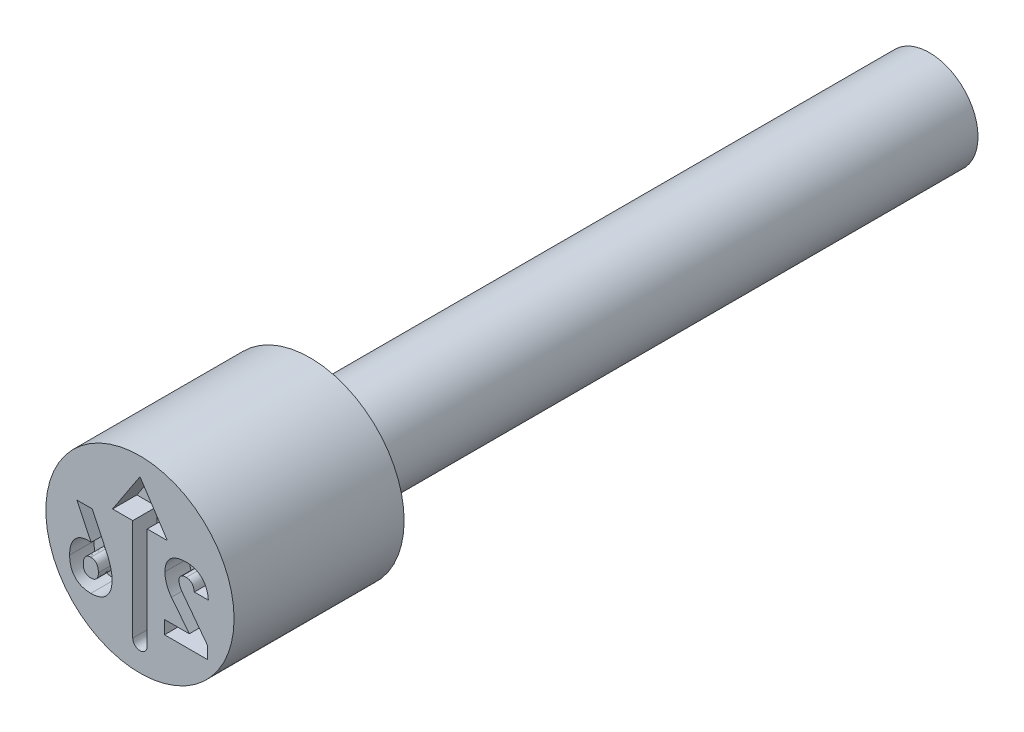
ISO-10303-21;
HEADER;
FILE_DESCRIPTION(('STEP AP214'),'2;1');
FILE_NAME('part.step','',(''),(''),'','','');
FILE_SCHEMA(('AUTOMOTIVE_DESIGN { 1 0 10303 214 1 1 1 1 }'));
ENDSEC;
DATA;
#1=APPLICATION_CONTEXT('core data for automotive mechanical design processes');
#2=APPLICATION_PROTOCOL_DEFINITION('international standard','automotive_design',2000,#1);
#3=PRODUCT_CONTEXT('',#1,'mechanical');
#4=PRODUCT('Part','Part','',(#3));
#5=PRODUCT_RELATED_PRODUCT_CATEGORY('part','',(#4));
#6=PRODUCT_DEFINITION_FORMATION('','',#4);
#7=PRODUCT_DEFINITION_CONTEXT('part definition',#1,'design');
#8=PRODUCT_DEFINITION('design','',#6,#7);
#9=PRODUCT_DEFINITION_SHAPE('','',#8);
#10=(LENGTH_UNIT() NAMED_UNIT(*) SI_UNIT(.MILLI.,.METRE.));
#11=(NAMED_UNIT(*) PLANE_ANGLE_UNIT() SI_UNIT($,.RADIAN.));
#12=(NAMED_UNIT(*) SI_UNIT($,.STERADIAN.) SOLID_ANGLE_UNIT());
#13=UNCERTAINTY_MEASURE_WITH_UNIT(LENGTH_MEASURE(1.E-05),#10,'distance_accuracy_value','');
#14=(GEOMETRIC_REPRESENTATION_CONTEXT(3) GLOBAL_UNCERTAINTY_ASSIGNED_CONTEXT((#13)) GLOBAL_UNIT_ASSIGNED_CONTEXT((#10,
#11,#12)) REPRESENTATION_CONTEXT('',''));
#15=CARTESIAN_POINT('',(0.,0.,0.));
#16=DIRECTION('',(0.,0.,1.));
#17=DIRECTION('',(1.,0.,0.));
#18=AXIS2_PLACEMENT_3D('',#15,#16,#17);
#19=CARTESIAN_POINT('',(0.,1.55,0.));
#20=DIRECTION('',(0.,0.,-1.));
#21=DIRECTION('',(-1.,0.,0.));
#22=AXIS2_PLACEMENT_3D('',#19,#20,#21);
#23=PLANE('',#22);
#24=DIRECTION('',(0.,1.,0.));
#25=VECTOR('',#24,1.);
#26=CARTESIAN_POINT('',(1.11112012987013,-0.8,0.));
#27=LINE('',#26,#25);
#28=CARTESIAN_POINT('',(1.11112012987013,-0.8,0.));
#29=VERTEX_POINT('',#28);
#30=CARTESIAN_POINT('',(1.11112012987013,-0.595941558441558,0.));
#31=VERTEX_POINT('',#30);
#32=EDGE_CURVE('E513',#29,#31,#27,.T.);
#33=ORIENTED_EDGE('',*,*,#32,.F.);
#34=DIRECTION('',(1.,0.,0.));
#35=VECTOR('',#34,1.);
#36=CARTESIAN_POINT('',(0.404464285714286,-0.8,0.));
#37=LINE('',#36,#35);
#38=CARTESIAN_POINT('',(0.404464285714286,-0.8,0.));
#39=VERTEX_POINT('',#38);
#40=EDGE_CURVE('E54',#39,#29,#37,.T.);
#41=ORIENTED_EDGE('',*,*,#40,.F.);
#42=DIRECTION('',(0.,-1.,0.));
#43=VECTOR('',#42,1.);
#44=CARTESIAN_POINT('',(0.404464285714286,-0.581818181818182,0.));
#45=LINE('',#44,#43);
#46=CARTESIAN_POINT('',(0.404464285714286,-0.581818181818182,0.));
#47=VERTEX_POINT('',#46);
#48=EDGE_CURVE('E317',#47,#39,#45,.T.);
#49=ORIENTED_EDGE('',*,*,#48,.F.);
#50=DIRECTION('',(-1.,0.,0.));
#51=VECTOR('',#50,1.);
#52=CARTESIAN_POINT('',(0.812824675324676,-0.581818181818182,0.));
#53=LINE('',#52,#51);
#54=CARTESIAN_POINT('',(0.812824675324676,-0.581818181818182,0.));
#55=VERTEX_POINT('',#54);
#56=EDGE_CURVE('E320',#55,#47,#53,.T.);
#57=ORIENTED_EDGE('',*,*,#56,.F.);
#58=DIRECTION('',(0.618183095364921,-0.786034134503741,0.));
#59=VECTOR('',#58,1.);
#60=CARTESIAN_POINT('',(0.518668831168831,-0.207792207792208,0.));
#61=LINE('',#60,#59);
#62=CARTESIAN_POINT('',(0.518668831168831,-0.207792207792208,0.));
#63=VERTEX_POINT('',#62);
#64=EDGE_CURVE('E1329',#63,#55,#61,.T.);
#65=ORIENTED_EDGE('',*,*,#64,.F.);
#66=CARTESIAN_POINT('',(0.411038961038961,0.100974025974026,0.));
#67=CARTESIAN_POINT('',(0.411349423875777,0.087320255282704,0.));
#68=CARTESIAN_POINT('',(0.411970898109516,0.0599885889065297,0.));
#69=CARTESIAN_POINT('',(0.417580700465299,0.019082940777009,0.));
#70=CARTESIAN_POINT('',(0.426620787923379,-0.0216138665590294,0.));
#71=CARTESIAN_POINT('',(0.439036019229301,-0.0619052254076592,0.));
#72=CARTESIAN_POINT('',(0.454458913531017,-0.101093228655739,0.));
#73=CARTESIAN_POINT('',(0.472969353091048,-0.138641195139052,0.));
#74=CARTESIAN_POINT('',(0.493860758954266,-0.174565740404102,0.));
#75=CARTESIAN_POINT('',(0.510415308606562,-0.196737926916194,0.));
#76=CARTESIAN_POINT('',(0.518668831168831,-0.207792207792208,0.));
#77=B_SPLINE_CURVE_WITH_KNOTS('',3,(#66,#67,#68,#69,#70,#71,#72,#73,#74,#75,#76),.UNSPECIFIED.,
.F.,.F.,(4,1,1,1,1,1,1,1,4),(0.,0.123046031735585,0.246309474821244,0.371480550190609,
0.498560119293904,0.626024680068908,0.750715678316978,0.875715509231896,1.),.UNSPECIFIED.);
#78=CARTESIAN_POINT('',(0.411038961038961,0.100974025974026,0.));
#79=VERTEX_POINT('',#78);
#80=EDGE_CURVE('E1324',#79,#63,#77,.T.);
#81=ORIENTED_EDGE('',*,*,#80,.F.);
#82=DIRECTION('',(0.,-1.,0.));
#83=VECTOR('',#82,1.);
#84=CARTESIAN_POINT('',(0.411038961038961,0.101948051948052,0.));
#85=LINE('',#84,#83);
#86=CARTESIAN_POINT('',(0.411038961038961,0.101948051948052,0.));
#87=VERTEX_POINT('',#86);
#88=EDGE_CURVE('E1318',#87,#79,#85,.T.);
#89=ORIENTED_EDGE('',*,*,#88,.F.);
#90=CARTESIAN_POINT('',(0.764366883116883,0.415584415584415,0.));
#91=CARTESIAN_POINT('',(0.750719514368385,0.415390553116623,0.));
#92=CARTESIAN_POINT('',(0.724177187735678,0.415013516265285,0.));
#93=CARTESIAN_POINT('',(0.685536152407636,0.410943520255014,0.));
#94=CARTESIAN_POINT('',(0.649179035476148,0.404800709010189,0.));
#95=CARTESIAN_POINT('',(0.615164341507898,0.395814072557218,0.));
#96=CARTESIAN_POINT('',(0.583628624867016,0.384091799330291,0.));
#97=CARTESIAN_POINT('',(0.554477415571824,0.369957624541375,0.));
#98=CARTESIAN_POINT('',(0.52764977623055,0.353291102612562,0.));
#99=CARTESIAN_POINT('',(0.503351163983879,0.33405660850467,0.));
#100=CARTESIAN_POINT('',(0.481488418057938,0.312603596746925,0.));
#101=CARTESIAN_POINT('',(0.462670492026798,0.288714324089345,0.));
#102=CARTESIAN_POINT('',(0.44638045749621,0.262871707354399,0.));
#103=CARTESIAN_POINT('',(0.433646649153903,0.2345745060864,0.));
#104=CARTESIAN_POINT('',(0.423163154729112,0.204488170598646,0.));
#105=CARTESIAN_POINT('',(0.416375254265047,0.172073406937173,0.));
#106=CARTESIAN_POINT('',(0.41180107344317,0.137711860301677,0.));
#107=CARTESIAN_POINT('',(0.411297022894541,0.114058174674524,0.));
#108=CARTESIAN_POINT('',(0.411038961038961,0.101948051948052,0.));
#109=B_SPLINE_CURVE_WITH_KNOTS('',3,(#90,#91,#92,#93,#94,#95,#96,#97,#98,#99,#100,#101,#102,
#103,#104,#105,#106,#107,#108),.UNSPECIFIED.,.F.,.F.,(4,1,1,1,1,1,1,1,1,1,1,1,1,1,1,1,4),(0.,
0.0762312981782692,0.148259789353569,0.216860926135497,0.28210063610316,0.344528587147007,
0.404571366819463,0.462840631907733,0.520642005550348,0.577409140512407,0.633580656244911,
0.690215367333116,0.747647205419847,0.806597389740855,0.867894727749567,0.932365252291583,1.),.UNSPECIFIED.);
#110=CARTESIAN_POINT('',(0.764366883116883,0.415584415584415,0.));
#111=VERTEX_POINT('',#110);
#112=EDGE_CURVE('E1310',#111,#87,#109,.T.);
#113=ORIENTED_EDGE('',*,*,#112,.F.);
#114=CARTESIAN_POINT('',(1.12597402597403,0.0554383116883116,0.));
#115=CARTESIAN_POINT('',(1.12483495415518,0.0693479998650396,0.));
#116=CARTESIAN_POINT('',(1.1226115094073,0.0964994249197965,0.));
#117=CARTESIAN_POINT('',(1.11532209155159,0.135775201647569,0.));
#118=CARTESIAN_POINT('',(1.10590080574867,0.17277029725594,0.));
#119=CARTESIAN_POINT('',(1.09391566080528,0.207477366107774,0.));
#120=CARTESIAN_POINT('',(1.07851470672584,0.239494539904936,0.));
#121=CARTESIAN_POINT('',(1.06121126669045,0.2694911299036,0.));
#122=CARTESIAN_POINT('',(1.04039956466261,0.296539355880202,0.));
#123=CARTESIAN_POINT('',(1.01761824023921,0.321544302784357,0.));
#124=CARTESIAN_POINT('',(0.992243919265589,0.343568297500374,0.));
#125=CARTESIAN_POINT('',(0.965187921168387,0.362996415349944,0.));
#126=CARTESIAN_POINT('',(0.936041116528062,0.379163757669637,0.));
#127=CARTESIAN_POINT('',(0.90524661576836,0.392575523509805,0.));
#128=CARTESIAN_POINT('',(0.87246299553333,0.402754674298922,0.));
#129=CARTESIAN_POINT('',(0.838118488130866,0.410379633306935,0.));
#130=CARTESIAN_POINT('',(0.80181888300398,0.414776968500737,0.));
#131=CARTESIAN_POINT('',(0.777040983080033,0.415311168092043,0.));
#132=CARTESIAN_POINT('',(0.764366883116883,0.415584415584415,0.));
#133=B_SPLINE_CURVE_WITH_KNOTS('',3,(#114,#115,#116,#117,#118,#119,#120,#121,#122,#123,#124,
#125,#126,#127,#128,#129,#130,#131,#132),.UNSPECIFIED.,.F.,.F.,(4,1,1,1,1,1,1,1,1,1,1,1,1,1,1,1,
4),(0.,0.0733268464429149,0.14313249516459,0.209679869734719,0.273918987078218,0.33576228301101,
0.396210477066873,0.45560885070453,0.514796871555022,0.573764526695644,0.631900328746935,
0.689592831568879,0.748648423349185,0.808163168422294,0.86976604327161,0.933384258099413,1.),.UNSPECIFIED.);
#134=CARTESIAN_POINT('',(1.12597402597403,0.0554383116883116,0.));
#135=VERTEX_POINT('',#134);
#136=EDGE_CURVE('E1305',#135,#111,#133,.T.);
#137=ORIENTED_EDGE('',*,*,#136,.F.);
#138=DIRECTION('',(0.,1.,0.));
#139=VECTOR('',#138,1.);
#140=CARTESIAN_POINT('',(1.12597402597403,0.0547077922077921,0.));
#141=LINE('',#140,#139);
#142=CARTESIAN_POINT('',(1.12597402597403,0.0547077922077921,0.));
#143=VERTEX_POINT('',#142);
#144=EDGE_CURVE('E1302',#143,#135,#141,.T.);
#145=ORIENTED_EDGE('',*,*,#144,.F.);
#146=DIRECTION('',(1.,0.,0.));
#147=VECTOR('',#146,1.);
#148=CARTESIAN_POINT('',(0.89512987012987,0.0547077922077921,0.));
#149=LINE('',#148,#147);
#150=CARTESIAN_POINT('',(0.89512987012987,0.0547077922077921,0.));
#151=VERTEX_POINT('',#150);
#152=EDGE_CURVE('E1299',#151,#143,#149,.T.);
#153=ORIENTED_EDGE('',*,*,#152,.F.);
#154=DIRECTION('',(0.,-1.,0.));
#155=VECTOR('',#154,1.);
#156=CARTESIAN_POINT('',(0.89512987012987,0.0554383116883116,0.));
#157=LINE('',#156,#155);
#158=CARTESIAN_POINT('',(0.89512987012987,0.0554383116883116,0.));
#159=VERTEX_POINT('',#158);
#160=EDGE_CURVE('E1293',#159,#151,#157,.T.);
#161=ORIENTED_EDGE('',*,*,#160,.F.);
#162=CARTESIAN_POINT('',(0.762662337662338,0.197402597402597,0.));
#163=CARTESIAN_POINT('',(0.771484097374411,0.197058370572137,0.));
#164=CARTESIAN_POINT('',(0.788625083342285,0.196389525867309,0.));
#165=CARTESIAN_POINT('',(0.812891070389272,0.188976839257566,0.));
#166=CARTESIAN_POINT('',(0.834757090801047,0.177349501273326,0.));
#167=CARTESIAN_POINT('',(0.853607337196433,0.160758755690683,0.));
#168=CARTESIAN_POINT('',(0.8692167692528,0.139928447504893,0.));
#169=CARTESIAN_POINT('',(0.881885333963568,0.115399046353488,0.));
#170=CARTESIAN_POINT('',(0.890489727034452,0.0867276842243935,0.));
#171=CARTESIAN_POINT('',(0.893533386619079,0.066203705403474,0.));
#172=CARTESIAN_POINT('',(0.89512987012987,0.0554383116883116,0.));
#173=B_SPLINE_CURVE_WITH_KNOTS('',3,(#162,#163,#164,#165,#166,#167,#168,#169,#170,#171,#172),
.UNSPECIFIED.,.F.,.F.,(4,1,1,1,1,1,1,1,4),(0.,0.122603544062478,0.238222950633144,
0.350089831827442,0.465559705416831,0.58502806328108,0.711014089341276,0.848418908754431,1.),.UNSPECIFIED.);
#174=CARTESIAN_POINT('',(0.762662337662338,0.197402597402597,0.));
#175=VERTEX_POINT('',#174);
#176=EDGE_CURVE('E1285',#175,#159,#173,.T.);
#177=ORIENTED_EDGE('',*,*,#176,.F.);
#178=CARTESIAN_POINT('',(0.642857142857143,0.095616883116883,0.));
#179=CARTESIAN_POINT('',(0.643189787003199,0.103289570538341,0.));
#180=CARTESIAN_POINT('',(0.643827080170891,0.11798921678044,0.));
#181=CARTESIAN_POINT('',(0.649831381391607,0.138701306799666,0.));
#182=CARTESIAN_POINT('',(0.659672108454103,0.156738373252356,0.));
#183=CARTESIAN_POINT('',(0.673766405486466,0.171636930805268,0.));
#184=CARTESIAN_POINT('',(0.691312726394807,0.183420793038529,0.));
#185=CARTESIAN_POINT('',(0.712307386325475,0.191725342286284,0.));
#186=CARTESIAN_POINT('',(0.736475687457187,0.196487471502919,0.));
#187=CARTESIAN_POINT('',(0.753630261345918,0.197086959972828,0.));
#188=CARTESIAN_POINT('',(0.762662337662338,0.197402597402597,0.));
#189=B_SPLINE_CURVE_WITH_KNOTS('',3,(#178,#179,#180,#181,#182,#183,#184,#185,#186,#187,#188),
.UNSPECIFIED.,.F.,.F.,(4,1,1,1,1,1,1,1,4),(0.,0.128749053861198,0.246662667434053,
0.359069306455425,0.47107757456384,0.588039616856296,0.711712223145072,0.848213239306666,1.),.UNSPECIFIED.);
#190=CARTESIAN_POINT('',(0.642857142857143,0.095616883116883,0.));
#191=VERTEX_POINT('',#190);
#192=EDGE_CURVE('E1280',#191,#175,#189,.T.);
#193=ORIENTED_EDGE('',*,*,#192,.F.);
#194=DIRECTION('',(0.,1.,0.));
#195=VECTOR('',#194,1.);
#196=CARTESIAN_POINT('',(0.642857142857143,0.0939123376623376,0.));
#197=LINE('',#196,#195);
#198=CARTESIAN_POINT('',(0.642857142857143,0.0939123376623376,0.));
#199=VERTEX_POINT('',#198);
#200=EDGE_CURVE('E1274',#199,#191,#197,.T.);
#201=ORIENTED_EDGE('',*,*,#200,.F.);
#202=CARTESIAN_POINT('',(0.701055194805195,-0.0526785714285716,0.));
#203=CARTESIAN_POINT('',(0.692466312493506,-0.040576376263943,0.));
#204=CARTESIAN_POINT('',(0.675731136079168,-0.0169956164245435,0.));
#205=CARTESIAN_POINT('',(0.660584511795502,0.0153877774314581,0.));
#206=CARTESIAN_POINT('',(0.651148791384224,0.0407767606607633,0.));
#207=CARTESIAN_POINT('',(0.646651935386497,0.0591887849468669,0.));
#208=CARTESIAN_POINT('',(0.643444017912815,0.0767555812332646,0.));
#209=CARTESIAN_POINT('',(0.64304917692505,0.0882983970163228,0.));
#210=CARTESIAN_POINT('',(0.642857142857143,0.0939123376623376,0.));
#211=B_SPLINE_CURVE_WITH_KNOTS('',3,(#202,#203,#204,#205,#206,#207,#208,#209,#210),
.UNSPECIFIED.,.F.,.F.,(4,1,1,1,1,1,4),(0.,0.27737542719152,0.540457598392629,0.666416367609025,
0.784009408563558,0.894951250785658,1.),.UNSPECIFIED.);
#212=CARTESIAN_POINT('',(0.701055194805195,-0.0526785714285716,0.));
#213=VERTEX_POINT('',#212);
#214=EDGE_CURVE('E1269',#213,#199,#211,.T.);
#215=ORIENTED_EDGE('',*,*,#214,.F.);
#216=DIRECTION('',(-0.602458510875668,0.798150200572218,0.));
#217=VECTOR('',#216,1.);
#218=CARTESIAN_POINT('',(1.11112012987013,-0.595941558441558,0.));
#219=LINE('',#218,#217);
#220=EDGE_CURVE('E1266',#31,#213,#219,.T.);
#221=ORIENTED_EDGE('',*,*,#220,.F.);
#222=EDGE_LOOP('',(#33,#41,#49,#57,#65,#81,#89,#113,#137,#145,#153,#161,#177,#193,#201,#215,#221));
#223=FACE_BOUND('',#222,.T.);
#224=CARTESIAN_POINT('',(-0.808480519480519,-0.815584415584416,0.));
#225=CARTESIAN_POINT('',(-0.794995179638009,-0.815313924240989,0.));
#226=CARTESIAN_POINT('',(-0.768761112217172,-0.814787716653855,0.));
#227=CARTESIAN_POINT('',(-0.730597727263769,-0.810424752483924,0.));
#228=CARTESIAN_POINT('',(-0.694824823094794,-0.80284651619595,0.));
#229=CARTESIAN_POINT('',(-0.661285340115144,-0.792388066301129,0.));
#230=CARTESIAN_POINT('',(-0.629978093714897,-0.779019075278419,0.));
#231=CARTESIAN_POINT('',(-0.601041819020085,-0.762628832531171,0.));
#232=CARTESIAN_POINT('',(-0.574462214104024,-0.743205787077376,0.));
#233=CARTESIAN_POINT('',(-0.550373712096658,-0.720791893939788,0.));
#234=CARTESIAN_POINT('',(-0.528945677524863,-0.69566674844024,0.));
#235=CARTESIAN_POINT('',(-0.510228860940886,-0.668075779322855,0.));
#236=CARTESIAN_POINT('',(-0.494381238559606,-0.638027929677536,0.));
#237=CARTESIAN_POINT('',(-0.481528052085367,-0.605507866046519,0.));
#238=CARTESIAN_POINT('',(-0.471446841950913,-0.570615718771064,0.));
#239=CARTESIAN_POINT('',(-0.464628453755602,-0.533327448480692,0.));
#240=CARTESIAN_POINT('',(-0.460036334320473,-0.493620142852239,0.));
#241=CARTESIAN_POINT('',(-0.459545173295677,-0.46632876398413,0.));
#242=CARTESIAN_POINT('',(-0.459292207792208,-0.452272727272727,0.));
#243=B_SPLINE_CURVE_WITH_KNOTS('',3,(#224,#225,#226,#227,#228,#229,#230,#231,#232,#233,#234,
#235,#236,#237,#238,#239,#240,#241,#242),.UNSPECIFIED.,.F.,.F.,(4,1,1,1,1,1,1,1,1,1,1,1,1,1,1,1,
4),(0.,0.0706034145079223,0.137350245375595,0.20079014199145,0.261822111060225,
0.321037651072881,0.37871381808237,0.435588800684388,0.493032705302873,0.550614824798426,
0.60814515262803,0.667276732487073,0.728130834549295,0.790952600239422,0.85714223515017,
0.926423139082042,1.),.UNSPECIFIED.);
#244=CARTESIAN_POINT('',(-0.808480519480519,-0.815584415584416,0.));
#245=VERTEX_POINT('',#244);
#246=CARTESIAN_POINT('',(-0.459292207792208,-0.452272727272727,0.));
#247=VERTEX_POINT('',#246);
#248=EDGE_CURVE('E518',#245,#247,#243,.T.);
#249=ORIENTED_EDGE('',*,*,#248,.F.);
#250=CARTESIAN_POINT('',(-1.15864285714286,-0.445698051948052,0.));
#251=CARTESIAN_POINT('',(-1.15838095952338,-0.459915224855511,0.));
#252=CARTESIAN_POINT('',(-1.15786932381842,-0.487689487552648,0.));
#253=CARTESIAN_POINT('',(-1.15335628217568,-0.528055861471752,0.));
#254=CARTESIAN_POINT('',(-1.14644134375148,-0.566051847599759,0.));
#255=CARTESIAN_POINT('',(-1.13645816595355,-0.601537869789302,0.));
#256=CARTESIAN_POINT('',(-1.1235444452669,-0.634602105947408,0.));
#257=CARTESIAN_POINT('',(-1.10768013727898,-0.665255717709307,0.));
#258=CARTESIAN_POINT('',(-1.08879225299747,-0.693347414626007,0.));
#259=CARTESIAN_POINT('',(-1.06741796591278,-0.71908087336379,0.));
#260=CARTESIAN_POINT('',(-1.04315959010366,-0.741725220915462,0.));
#261=CARTESIAN_POINT('',(-1.01666775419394,-0.761622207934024,0.));
#262=CARTESIAN_POINT('',(-0.987849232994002,-0.778622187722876,0.));
#263=CARTESIAN_POINT('',(-0.956277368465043,-0.791846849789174,0.));
#264=CARTESIAN_POINT('',(-0.922674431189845,-0.802702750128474,0.));
#265=CARTESIAN_POINT('',(-0.886577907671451,-0.810076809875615,0.));
#266=CARTESIAN_POINT('',(-0.848301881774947,-0.814870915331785,0.));
#267=CARTESIAN_POINT('',(-0.821969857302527,-0.815342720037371,0.));
#268=CARTESIAN_POINT('',(-0.808480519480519,-0.815584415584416,0.));
#269=B_SPLINE_CURVE_WITH_KNOTS('',3,(#250,#251,#252,#253,#254,#255,#256,#257,#258,#259,#260,
#261,#262,#263,#264,#265,#266,#267,#268),.UNSPECIFIED.,.F.,.F.,(4,1,1,1,1,1,1,1,1,1,1,1,1,1,1,1,
4),(0.,0.0736363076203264,0.143853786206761,0.210167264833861,0.273535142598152,
0.334525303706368,0.393774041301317,0.451974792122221,0.509587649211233,0.566708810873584,
0.623480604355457,0.680964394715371,0.739551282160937,0.800463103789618,0.863640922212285,
0.930146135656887,1.),.UNSPECIFIED.);
#270=CARTESIAN_POINT('',(-1.15864285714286,-0.445698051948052,0.));
#271=VERTEX_POINT('',#270);
#272=EDGE_CURVE('E62',#271,#245,#269,.T.);
#273=ORIENTED_EDGE('',*,*,#272,.F.);
#274=DIRECTION('',(0.,-1.,0.));
#275=VECTOR('',#274,1.);
#276=CARTESIAN_POINT('',(-1.15864285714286,-0.444724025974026,0.));
#277=LINE('',#276,#275);
#278=CARTESIAN_POINT('',(-1.15864285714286,-0.444724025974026,0.));
#279=VERTEX_POINT('',#278);
#280=EDGE_CURVE('E438',#279,#271,#277,.T.);
#281=ORIENTED_EDGE('',*,*,#280,.F.);
#282=CARTESIAN_POINT('',(-0.847198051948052,-0.0831168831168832,0.));
#283=CARTESIAN_POINT('',(-0.859223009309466,-0.0833895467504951,0.));
#284=CARTESIAN_POINT('',(-0.882626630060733,-0.0839202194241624,0.));
#285=CARTESIAN_POINT('',(-0.916680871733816,-0.0882619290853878,0.));
#286=CARTESIAN_POINT('',(-0.948507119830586,-0.0959559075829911,0.));
#287=CARTESIAN_POINT('',(-0.978506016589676,-0.106055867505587,0.));
#288=CARTESIAN_POINT('',(-1.00636260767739,-0.119524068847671,0.));
#289=CARTESIAN_POINT('',(-1.03214597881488,-0.136003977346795,0.));
#290=CARTESIAN_POINT('',(-1.0559162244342,-0.155298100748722,0.));
#291=CARTESIAN_POINT('',(-1.07736006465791,-0.177638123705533,0.));
#292=CARTESIAN_POINT('',(-1.09667859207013,-0.202454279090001,0.));
#293=CARTESIAN_POINT('',(-1.11323378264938,-0.229997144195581,0.));
#294=CARTESIAN_POINT('',(-1.12746083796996,-0.259806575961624,0.));
#295=CARTESIAN_POINT('',(-1.13879513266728,-0.29218065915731,0.));
#296=CARTESIAN_POINT('',(-1.14787906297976,-0.326856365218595,0.));
#297=CARTESIAN_POINT('',(-1.15401272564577,-0.364030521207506,0.));
#298=CARTESIAN_POINT('',(-1.15806914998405,-0.403562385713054,0.));
#299=CARTESIAN_POINT('',(-1.15844811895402,-0.430752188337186,0.));
#300=CARTESIAN_POINT('',(-1.15864285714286,-0.444724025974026,0.));
#301=B_SPLINE_CURVE_WITH_KNOTS('',3,(#282,#283,#284,#285,#286,#287,#288,#289,#290,#291,#292,
#293,#294,#295,#296,#297,#298,#299,#300),.UNSPECIFIED.,.F.,.F.,(4,1,1,1,1,1,1,1,1,1,1,1,1,1,1,1,
4),(0.,0.0665766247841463,0.129575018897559,0.18964484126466,0.24763903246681,0.30453064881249,
0.36051483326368,0.416743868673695,0.473642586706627,0.531631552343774,0.590524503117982,
0.65124161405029,0.714220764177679,0.780176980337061,0.849489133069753,0.922658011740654,1.),.UNSPECIFIED.);
#302=CARTESIAN_POINT('',(-0.847198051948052,-0.0831168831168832,0.));
#303=VERTEX_POINT('',#302);
#304=EDGE_CURVE('E619',#303,#279,#301,.T.);
#305=ORIENTED_EDGE('',*,*,#304,.F.);
#306=CARTESIAN_POINT('',(-0.695006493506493,-0.164935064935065,0.));
#307=CARTESIAN_POINT('',(-0.698695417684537,-0.158382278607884,0.));
#308=CARTESIAN_POINT('',(-0.705925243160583,-0.145539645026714,0.));
#309=CARTESIAN_POINT('',(-0.720166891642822,-0.12891830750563,0.));
#310=CARTESIAN_POINT('',(-0.736050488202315,-0.114484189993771,0.));
#311=CARTESIAN_POINT('',(-0.754420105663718,-0.103003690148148,0.));
#312=CARTESIAN_POINT('',(-0.774731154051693,-0.0939208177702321,0.));
#313=CARTESIAN_POINT('',(-0.797149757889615,-0.0877286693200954,0.));
#314=CARTESIAN_POINT('',(-0.821482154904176,-0.0836662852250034,0.));
#315=CARTESIAN_POINT('',(-0.838414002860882,-0.083304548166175,0.));
#316=CARTESIAN_POINT('',(-0.847198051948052,-0.0831168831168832,0.));
#317=B_SPLINE_CURVE_WITH_KNOTS('',3,(#306,#307,#308,#309,#310,#311,#312,#313,#314,#315,#316),
.UNSPECIFIED.,.F.,.F.,(4,1,1,1,1,1,1,1,4),(0.,0.123274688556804,0.241602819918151,
0.357777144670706,0.474683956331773,0.595870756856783,0.722082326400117,0.855819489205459,1.),.UNSPECIFIED.);
#318=CARTESIAN_POINT('',(-0.803914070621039,-0.086767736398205,0.));
#319=VERTEX_POINT('',#318);
#320=EDGE_CURVE('E624',#319,#303,#317,.T.);
#321=ORIENTED_EDGE('',*,*,#320,.F.);
#322=DIRECTION('',(0.435377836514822,-0.900247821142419,0.));
#323=VECTOR('',#322,1.);
#324=CARTESIAN_POINT('',(-1.03932467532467,0.4,0.));
#325=LINE('',#324,#323);
#326=CARTESIAN_POINT('',(-1.03932467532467,0.4,0.));
#327=VERTEX_POINT('',#326);
#328=EDGE_CURVE('E632',#327,#319,#325,.T.);
#329=ORIENTED_EDGE('',*,*,#328,.F.);
#330=DIRECTION('',(-1.,0.,0.));
#331=VECTOR('',#330,1.);
#332=CARTESIAN_POINT('',(-0.784616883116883,0.4,0.));
#333=LINE('',#332,#331);
#334=CARTESIAN_POINT('',(-0.784616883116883,0.4,0.));
#335=VERTEX_POINT('',#334);
#336=EDGE_CURVE('E638',#335,#327,#333,.T.);
#337=ORIENTED_EDGE('',*,*,#336,.F.);
#338=DIRECTION('',(-0.424073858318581,0.905627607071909,0.));
#339=VECTOR('',#338,1.);
#340=CARTESIAN_POINT('',(-0.542084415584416,-0.117938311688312,0.));
#341=LINE('',#340,#339);
#342=CARTESIAN_POINT('',(-0.542084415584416,-0.117938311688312,0.));
#343=VERTEX_POINT('',#342);
#344=EDGE_CURVE('E641',#343,#335,#341,.T.);
#345=ORIENTED_EDGE('',*,*,#344,.F.);
#346=CARTESIAN_POINT('',(-0.459292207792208,-0.451542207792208,0.));
#347=CARTESIAN_POINT('',(-0.459599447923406,-0.438382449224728,0.));
#348=CARTESIAN_POINT('',(-0.460224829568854,-0.411596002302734,0.));
#349=CARTESIAN_POINT('',(-0.464586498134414,-0.370940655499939,0.));
#350=CARTESIAN_POINT('',(-0.471325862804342,-0.329197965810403,0.));
#351=CARTESIAN_POINT('',(-0.481211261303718,-0.286741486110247,0.));
#352=CARTESIAN_POINT('',(-0.493265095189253,-0.244005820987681,0.));
#353=CARTESIAN_POINT('',(-0.507544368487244,-0.201483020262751,0.));
#354=CARTESIAN_POINT('',(-0.523422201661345,-0.159273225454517,0.));
#355=CARTESIAN_POINT('',(-0.535846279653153,-0.131755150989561,0.));
#356=CARTESIAN_POINT('',(-0.542084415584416,-0.117938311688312,0.));
#357=B_SPLINE_CURVE_WITH_KNOTS('',3,(#346,#347,#348,#349,#350,#351,#352,#353,#354,#355,#356),
.UNSPECIFIED.,.F.,.F.,(4,1,1,1,1,1,1,1,4),(0.,0.114002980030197,0.232050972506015,
0.353906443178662,0.480147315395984,0.609491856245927,0.738474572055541,0.868687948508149,1.),.UNSPECIFIED.);
#358=CARTESIAN_POINT('',(-0.459292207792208,-0.451542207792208,0.));
#359=VERTEX_POINT('',#358);
#360=EDGE_CURVE('E644',#359,#343,#357,.T.);
#361=ORIENTED_EDGE('',*,*,#360,.F.);
#362=DIRECTION('',(0.,1.,0.));
#363=VECTOR('',#362,1.);
#364=CARTESIAN_POINT('',(-0.459292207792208,-0.452272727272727,0.));
#365=LINE('',#364,#363);
#366=EDGE_CURVE('E649',#247,#359,#365,.T.);
#367=ORIENTED_EDGE('',*,*,#366,.F.);
#368=EDGE_LOOP('',(#249,#273,#281,#305,#321,#329,#337,#345,#361,#367));
#369=FACE_BOUND('',#368,.T.);
#370=CARTESIAN_POINT('',(0.,0.,0.));
#371=DIRECTION('',(0.,0.,1.));
#372=DIRECTION('',(1.,0.,0.));
#373=AXIS2_PLACEMENT_3D('',#370,#371,#372);
#374=CIRCLE('',#373,1.55);
#375=CARTESIAN_POINT('',(1.55,0.,0.));
#376=VERTEX_POINT('',#375);
#377=EDGE_CURVE('E47',#376,#376,#374,.T.);
#378=ORIENTED_EDGE('',*,*,#377,.T.);
#379=EDGE_LOOP('',(#378));
#380=FACE_BOUND('',#379,.T.);
#381=DIRECTION('',(0.,1.,0.));
#382=VECTOR('',#381,1.);
#383=CARTESIAN_POINT('',(0.119045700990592,0.566469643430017,0.));
#384=LINE('',#383,#382);
#385=CARTESIAN_POINT('',(0.119045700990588,-1.11010114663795,0.));
#386=VERTEX_POINT('',#385);
#387=CARTESIAN_POINT('',(0.119045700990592,0.566469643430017,0.));
#388=VERTEX_POINT('',#387);
#389=EDGE_CURVE('E525',#386,#388,#384,.T.);
#390=ORIENTED_EDGE('',*,*,#389,.F.);
#391=CARTESIAN_POINT('',(1.02140308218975E-13,-1.11010114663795,0.));
#392=DIRECTION('',(0.,0.,1.));
#393=DIRECTION('',(1.,0.,0.));
#394=AXIS2_PLACEMENT_3D('',#391,#392,#393);
#395=CIRCLE('',#394,0.119045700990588);
#396=CARTESIAN_POINT('',(-0.119045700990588,-1.11010114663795,0.));
#397=VERTEX_POINT('',#396);
#398=EDGE_CURVE('E527',#397,#386,#395,.T.);
#399=ORIENTED_EDGE('',*,*,#398,.F.);
#400=DIRECTION('',(0.,-1.,0.));
#401=VECTOR('',#400,1.);
#402=CARTESIAN_POINT('',(-0.119045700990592,0.566469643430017,0.));
#403=LINE('',#402,#401);
#404=CARTESIAN_POINT('',(-0.119045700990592,0.566469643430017,0.));
#405=VERTEX_POINT('',#404);
#406=EDGE_CURVE('E547',#405,#397,#403,.T.);
#407=ORIENTED_EDGE('',*,*,#406,.F.);
#408=DIRECTION('',(1.,0.,0.));
#409=VECTOR('',#408,1.);
#410=CARTESIAN_POINT('',(-0.451198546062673,0.566469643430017,0.));
#411=LINE('',#410,#409);
#412=CARTESIAN_POINT('',(-0.451198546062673,0.566469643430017,0.));
#413=VERTEX_POINT('',#412);
#414=EDGE_CURVE('E544',#413,#405,#411,.T.);
#415=ORIENTED_EDGE('',*,*,#414,.F.);
#416=DIRECTION('',(-0.550159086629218,-0.835059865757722,0.));
#417=VECTOR('',#416,1.);
#418=CARTESIAN_POINT('',(0.,1.25132209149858,0.));
#419=LINE('',#418,#417);
#420=CARTESIAN_POINT('',(0.,1.25132209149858,0.));
#421=VERTEX_POINT('',#420);
#422=EDGE_CURVE('E541',#421,#413,#419,.T.);
#423=ORIENTED_EDGE('',*,*,#422,.F.);
#424=DIRECTION('',(-0.550159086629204,0.835059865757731,0.));
#425=VECTOR('',#424,1.);
#426=CARTESIAN_POINT('',(0.,1.25132209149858,0.));
#427=LINE('',#426,#425);
#428=CARTESIAN_POINT('',(0.451198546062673,0.566469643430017,0.));
#429=VERTEX_POINT('',#428);
#430=EDGE_CURVE('E533',#429,#421,#427,.T.);
#431=ORIENTED_EDGE('',*,*,#430,.F.);
#432=DIRECTION('',(1.,0.,0.));
#433=VECTOR('',#432,1.);
#434=CARTESIAN_POINT('',(0.451198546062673,0.566469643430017,0.));
#435=LINE('',#434,#433);
#436=EDGE_CURVE('E530',#388,#429,#435,.T.);
#437=ORIENTED_EDGE('',*,*,#436,.F.);
#438=EDGE_LOOP('',(#390,#399,#407,#415,#423,#431,#437));
#439=FACE_BOUND('',#438,.T.);
#440=ADVANCED_FACE('F39',(#223,#369,#380,#439),#23,.F.);
#441=CARTESIAN_POINT('',(0.,0.799999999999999,-2.8));
#442=DIRECTION('',(0.,0.,1.));
#443=DIRECTION('',(1.,0.,0.));
#444=AXIS2_PLACEMENT_3D('',#441,#442,#443);
#445=PLANE('',#444);
#446=CARTESIAN_POINT('',(0.,0.,-2.8));
#447=DIRECTION('',(0.,0.,1.));
#448=DIRECTION('',(1.,0.,0.));
#449=AXIS2_PLACEMENT_3D('',#446,#447,#448);
#450=CIRCLE('',#449,1.55);
#451=CARTESIAN_POINT('',(1.55,0.,-2.8));
#452=VERTEX_POINT('',#451);
#453=EDGE_CURVE('E11',#452,#452,#450,.T.);
#454=ORIENTED_EDGE('',*,*,#453,.F.);
#455=EDGE_LOOP('',(#454));
#456=FACE_BOUND('',#455,.T.);
#457=CARTESIAN_POINT('',(0.,0.,-2.8));
#458=DIRECTION('',(0.,0.,1.));
#459=DIRECTION('',(1.,0.,0.));
#460=AXIS2_PLACEMENT_3D('',#457,#458,#459);
#461=CIRCLE('',#460,0.799999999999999);
#462=CARTESIAN_POINT('',(0.799999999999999,0.,-2.8));
#463=VERTEX_POINT('',#462);
#464=EDGE_CURVE('E553',#463,#463,#461,.T.);
#465=ORIENTED_EDGE('',*,*,#464,.T.);
#466=EDGE_LOOP('',(#465));
#467=FACE_BOUND('',#466,.T.);
#468=ADVANCED_FACE('F41',(#456,#467),#445,.F.);
#469=CARTESIAN_POINT('',(0.,0.,-0.403888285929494));
#470=DIRECTION('',(0.,0.,1.));
#471=DIRECTION('',(1.,0.,0.));
#472=AXIS2_PLACEMENT_3D('',#469,#470,#471);
#473=CYLINDRICAL_SURFACE('',#472,1.55);
#474=ORIENTED_EDGE('',*,*,#377,.F.);
#475=EDGE_LOOP('',(#474));
#476=FACE_BOUND('',#475,.T.);
#477=ORIENTED_EDGE('',*,*,#453,.T.);
#478=EDGE_LOOP('',(#477));
#479=FACE_BOUND('',#478,.T.);
#480=ADVANCED_FACE('F494',(#476,#479),#473,.T.);
#481=CARTESIAN_POINT('',(0.,0.,-13.));
#482=DIRECTION('',(0.,0.,1.));
#483=DIRECTION('',(1.,0.,0.));
#484=AXIS2_PLACEMENT_3D('',#481,#482,#483);
#485=PLANE('',#484);
#486=CARTESIAN_POINT('',(0.,0.,-13.));
#487=DIRECTION('',(0.,0.,1.));
#488=DIRECTION('',(1.,0.,0.));
#489=AXIS2_PLACEMENT_3D('',#486,#487,#488);
#490=CIRCLE('',#489,0.8);
#491=CARTESIAN_POINT('',(0.8,0.,-13.));
#492=VERTEX_POINT('',#491);
#493=EDGE_CURVE('E569',#492,#492,#490,.T.);
#494=ORIENTED_EDGE('',*,*,#493,.F.);
#495=EDGE_LOOP('',(#494));
#496=FACE_BOUND('',#495,.T.);
#497=ADVANCED_FACE('F490',(#496),#485,.F.);
#498=CARTESIAN_POINT('',(0.,0.,-0.403888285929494));
#499=DIRECTION('',(0.,0.,1.));
#500=DIRECTION('',(1.,0.,0.));
#501=AXIS2_PLACEMENT_3D('',#498,#499,#500);
#502=CYLINDRICAL_SURFACE('',#501,0.8);
#503=ORIENTED_EDGE('',*,*,#464,.F.);
#504=EDGE_LOOP('',(#503));
#505=FACE_BOUND('',#504,.T.);
#506=ORIENTED_EDGE('',*,*,#493,.T.);
#507=EDGE_LOOP('',(#506));
#508=FACE_BOUND('',#507,.T.);
#509=ADVANCED_FACE('F486',(#505,#508),#502,.T.);
#510=CARTESIAN_POINT('',(1.02140308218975E-13,-1.11010114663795,-0.4));
#511=DIRECTION('',(0.,0.,1.));
#512=DIRECTION('',(1.,0.,0.));
#513=AXIS2_PLACEMENT_3D('',#510,#511,#512);
#514=CYLINDRICAL_SURFACE('',#513,0.119045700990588);
#515=ORIENTED_EDGE('',*,*,#398,.T.);
#516=DIRECTION('',(0.,0.,1.));
#517=VECTOR('',#516,1.);
#518=CARTESIAN_POINT('',(0.119045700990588,-1.11010114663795,-0.4));
#519=LINE('',#518,#517);
#520=CARTESIAN_POINT('',(0.119045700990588,-1.11010114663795,-0.4));
#521=VERTEX_POINT('',#520);
#522=EDGE_CURVE('E564',#521,#386,#519,.T.);
#523=ORIENTED_EDGE('',*,*,#522,.F.);
#524=CARTESIAN_POINT('',(1.02140308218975E-13,-1.11010114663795,-0.4));
#525=DIRECTION('',(0.,0.,1.));
#526=DIRECTION('',(1.,0.,0.));
#527=AXIS2_PLACEMENT_3D('',#524,#525,#526);
#528=CIRCLE('',#527,0.119045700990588);
#529=CARTESIAN_POINT('',(-0.119045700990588,-1.11010114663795,-0.4));
#530=VERTEX_POINT('',#529);
#531=EDGE_CURVE('E550',#530,#521,#528,.T.);
#532=ORIENTED_EDGE('',*,*,#531,.F.);
#533=DIRECTION('',(0.,0.,1.));
#534=VECTOR('',#533,1.);
#535=CARTESIAN_POINT('',(-0.119045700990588,-1.11010114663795,-0.4));
#536=LINE('',#535,#534);
#537=EDGE_CURVE('E551',#530,#397,#536,.T.);
#538=ORIENTED_EDGE('',*,*,#537,.T.);
#539=EDGE_LOOP('',(#515,#523,#532,#538));
#540=FACE_BOUND('',#539,.T.);
#541=ADVANCED_FACE('F464',(#540),#514,.F.);
#542=CARTESIAN_POINT('',(-0.119045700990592,0.566469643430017,-0.4));
#543=DIRECTION('',(-1.,0.,0.));
#544=DIRECTION('',(0.,-1.,0.));
#545=AXIS2_PLACEMENT_3D('',#542,#543,#544);
#546=PLANE('',#545);
#547=ORIENTED_EDGE('',*,*,#406,.T.);
#548=ORIENTED_EDGE('',*,*,#537,.F.);
#549=DIRECTION('',(0.,-1.,0.));
#550=VECTOR('',#549,1.);
#551=CARTESIAN_POINT('',(-0.119045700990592,0.566469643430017,-0.4));
#552=LINE('',#551,#550);
#553=CARTESIAN_POINT('',(-0.119045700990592,0.566469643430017,-0.4));
#554=VERTEX_POINT('',#553);
#555=EDGE_CURVE('E566',#554,#530,#552,.T.);
#556=ORIENTED_EDGE('',*,*,#555,.F.);
#557=DIRECTION('',(0.,0.,1.));
#558=VECTOR('',#557,1.);
#559=CARTESIAN_POINT('',(-0.119045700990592,0.566469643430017,-0.4));
#560=LINE('',#559,#558);
#561=EDGE_CURVE('E554',#554,#405,#560,.T.);
#562=ORIENTED_EDGE('',*,*,#561,.T.);
#563=EDGE_LOOP('',(#547,#548,#556,#562));
#564=FACE_BOUND('',#563,.T.);
#565=ADVANCED_FACE('F460',(#564),#546,.F.);
#566=CARTESIAN_POINT('',(-0.451198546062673,0.566469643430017,-0.4));
#567=DIRECTION('',(0.,-1.,0.));
#568=DIRECTION('',(0.,0.,-1.));
#569=AXIS2_PLACEMENT_3D('',#566,#567,#568);
#570=PLANE('',#569);
#571=ORIENTED_EDGE('',*,*,#414,.T.);
#572=ORIENTED_EDGE('',*,*,#561,.F.);
#573=DIRECTION('',(1.,0.,0.));
#574=VECTOR('',#573,1.);
#575=CARTESIAN_POINT('',(-0.451198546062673,0.566469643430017,-0.4));
#576=LINE('',#575,#574);
#577=CARTESIAN_POINT('',(-0.451198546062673,0.566469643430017,-0.4));
#578=VERTEX_POINT('',#577);
#579=EDGE_CURVE('E577',#578,#554,#576,.T.);
#580=ORIENTED_EDGE('',*,*,#579,.F.);
#581=DIRECTION('',(0.,0.,1.));
#582=VECTOR('',#581,1.);
#583=CARTESIAN_POINT('',(-0.451198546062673,0.566469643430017,-0.4));
#584=LINE('',#583,#582);
#585=EDGE_CURVE('E556',#578,#413,#584,.T.);
#586=ORIENTED_EDGE('',*,*,#585,.T.);
#587=EDGE_LOOP('',(#571,#572,#580,#586));
#588=FACE_BOUND('',#587,.T.);
#589=ADVANCED_FACE('F463',(#588),#570,.F.);
#590=CARTESIAN_POINT('',(0.,1.25132209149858,-0.4));
#591=DIRECTION('',(-0.835059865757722,0.550159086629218,0.));
#592=DIRECTION('',(-0.550159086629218,-0.835059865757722,0.));
#593=AXIS2_PLACEMENT_3D('',#590,#591,#592);
#594=PLANE('',#593);
#595=ORIENTED_EDGE('',*,*,#422,.T.);
#596=ORIENTED_EDGE('',*,*,#585,.F.);
#597=DIRECTION('',(-0.550159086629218,-0.835059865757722,0.));
#598=VECTOR('',#597,1.);
#599=CARTESIAN_POINT('',(0.,1.25132209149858,-0.4));
#600=LINE('',#599,#598);
#601=CARTESIAN_POINT('',(0.,1.25132209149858,-0.4));
#602=VERTEX_POINT('',#601);
#603=EDGE_CURVE('E581',#602,#578,#600,.T.);
#604=ORIENTED_EDGE('',*,*,#603,.F.);
#605=DIRECTION('',(0.,0.,1.));
#606=VECTOR('',#605,1.);
#607=CARTESIAN_POINT('',(0.,1.25132209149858,-0.4));
#608=LINE('',#607,#606);
#609=EDGE_CURVE('E558',#602,#421,#608,.T.);
#610=ORIENTED_EDGE('',*,*,#609,.T.);
#611=EDGE_LOOP('',(#595,#596,#604,#610));
#612=FACE_BOUND('',#611,.T.);
#613=ADVANCED_FACE('F468',(#612),#594,.F.);
#614=CARTESIAN_POINT('',(0.,1.25132209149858,-0.4));
#615=DIRECTION('',(0.835059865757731,0.550159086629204,0.));
#616=DIRECTION('',(-0.550159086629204,0.835059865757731,0.));
#617=AXIS2_PLACEMENT_3D('',#614,#615,#616);
#618=PLANE('',#617);
#619=ORIENTED_EDGE('',*,*,#430,.T.);
#620=ORIENTED_EDGE('',*,*,#609,.F.);
#621=DIRECTION('',(-0.550159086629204,0.835059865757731,0.));
#622=VECTOR('',#621,1.);
#623=CARTESIAN_POINT('',(0.,1.25132209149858,-0.4));
#624=LINE('',#623,#622);
#625=CARTESIAN_POINT('',(0.451198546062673,0.566469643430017,-0.4));
#626=VERTEX_POINT('',#625);
#627=EDGE_CURVE('E586',#626,#602,#624,.T.);
#628=ORIENTED_EDGE('',*,*,#627,.F.);
#629=DIRECTION('',(0.,0.,1.));
#630=VECTOR('',#629,1.);
#631=CARTESIAN_POINT('',(0.451198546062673,0.566469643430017,-0.4));
#632=LINE('',#631,#630);
#633=EDGE_CURVE('E560',#626,#429,#632,.T.);
#634=ORIENTED_EDGE('',*,*,#633,.T.);
#635=EDGE_LOOP('',(#619,#620,#628,#634));
#636=FACE_BOUND('',#635,.T.);
#637=ADVANCED_FACE('F472',(#636),#618,.F.);
#638=CARTESIAN_POINT('',(0.451198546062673,0.566469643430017,-0.4));
#639=DIRECTION('',(0.,-1.,0.));
#640=DIRECTION('',(0.,0.,-1.));
#641=AXIS2_PLACEMENT_3D('',#638,#639,#640);
#642=PLANE('',#641);
#643=ORIENTED_EDGE('',*,*,#436,.T.);
#644=ORIENTED_EDGE('',*,*,#633,.F.);
#645=DIRECTION('',(1.,0.,0.));
#646=VECTOR('',#645,1.);
#647=CARTESIAN_POINT('',(0.451198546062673,0.566469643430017,-0.4));
#648=LINE('',#647,#646);
#649=CARTESIAN_POINT('',(0.119045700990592,0.566469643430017,-0.4));
#650=VERTEX_POINT('',#649);
#651=EDGE_CURVE('E589',#650,#626,#648,.T.);
#652=ORIENTED_EDGE('',*,*,#651,.F.);
#653=DIRECTION('',(0.,0.,1.));
#654=VECTOR('',#653,1.);
#655=CARTESIAN_POINT('',(0.119045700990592,0.566469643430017,-0.4));
#656=LINE('',#655,#654);
#657=EDGE_CURVE('E562',#650,#388,#656,.T.);
#658=ORIENTED_EDGE('',*,*,#657,.T.);
#659=EDGE_LOOP('',(#643,#644,#652,#658));
#660=FACE_BOUND('',#659,.T.);
#661=ADVANCED_FACE('F476',(#660),#642,.F.);
#662=CARTESIAN_POINT('',(0.119045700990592,0.566469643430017,-0.4));
#663=DIRECTION('',(1.,0.,0.));
#664=DIRECTION('',(0.,1.,0.));
#665=AXIS2_PLACEMENT_3D('',#662,#663,#664);
#666=PLANE('',#665);
#667=ORIENTED_EDGE('',*,*,#389,.T.);
#668=ORIENTED_EDGE('',*,*,#657,.F.);
#669=DIRECTION('',(0.,1.,0.));
#670=VECTOR('',#669,1.);
#671=CARTESIAN_POINT('',(0.119045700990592,0.566469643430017,-0.4));
#672=LINE('',#671,#670);
#673=EDGE_CURVE('E592',#521,#650,#672,.T.);
#674=ORIENTED_EDGE('',*,*,#673,.F.);
#675=ORIENTED_EDGE('',*,*,#522,.T.);
#676=EDGE_LOOP('',(#667,#668,#674,#675));
#677=FACE_BOUND('',#676,.T.);
#678=ADVANCED_FACE('F458',(#677),#666,.F.);
#679=CARTESIAN_POINT('',(1.02140308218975E-13,-1.11010114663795,-0.4));
#680=DIRECTION('',(0.,0.,1.));
#681=DIRECTION('',(1.,0.,0.));
#682=AXIS2_PLACEMENT_3D('',#679,#680,#681);
#683=PLANE('',#682);
#684=ORIENTED_EDGE('',*,*,#531,.T.);
#685=ORIENTED_EDGE('',*,*,#673,.T.);
#686=ORIENTED_EDGE('',*,*,#651,.T.);
#687=ORIENTED_EDGE('',*,*,#627,.T.);
#688=ORIENTED_EDGE('',*,*,#603,.T.);
#689=ORIENTED_EDGE('',*,*,#579,.T.);
#690=ORIENTED_EDGE('',*,*,#555,.T.);
#691=EDGE_LOOP('',(#684,#685,#686,#687,#688,#689,#690));
#692=FACE_BOUND('',#691,.T.);
#693=ADVANCED_FACE('F455',(#692),#683,.T.);
#694=CARTESIAN_POINT('',(-1.0706110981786,-0.714591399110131,-0.4));
#695=DIRECTION('',(0.,0.,-1.));
#696=DIRECTION('',(-1.,0.,0.));
#697=AXIS2_PLACEMENT_3D('',#694,#695,#696);
#698=PLANE('',#697);
#699=CARTESIAN_POINT('',(-1.15864285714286,-0.445698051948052,-0.4));
#700=CARTESIAN_POINT('',(-1.15838095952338,-0.459915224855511,-0.4));
#701=CARTESIAN_POINT('',(-1.15786932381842,-0.487689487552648,-0.4));
#702=CARTESIAN_POINT('',(-1.15335628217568,-0.528055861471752,-0.4));
#703=CARTESIAN_POINT('',(-1.14644134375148,-0.566051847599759,-0.4));
#704=CARTESIAN_POINT('',(-1.13645816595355,-0.601537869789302,-0.4));
#705=CARTESIAN_POINT('',(-1.1235444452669,-0.634602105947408,-0.4));
#706=CARTESIAN_POINT('',(-1.10768013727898,-0.665255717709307,-0.4));
#707=CARTESIAN_POINT('',(-1.08879225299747,-0.693347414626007,-0.4));
#708=CARTESIAN_POINT('',(-1.06741796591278,-0.71908087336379,-0.4));
#709=CARTESIAN_POINT('',(-1.04315959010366,-0.741725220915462,-0.4));
#710=CARTESIAN_POINT('',(-1.01666775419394,-0.761622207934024,-0.4));
#711=CARTESIAN_POINT('',(-0.987849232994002,-0.778622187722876,-0.4));
#712=CARTESIAN_POINT('',(-0.956277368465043,-0.791846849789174,-0.4));
#713=CARTESIAN_POINT('',(-0.922674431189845,-0.802702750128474,-0.4));
#714=CARTESIAN_POINT('',(-0.886577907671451,-0.810076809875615,-0.4));
#715=CARTESIAN_POINT('',(-0.848301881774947,-0.814870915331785,-0.4));
#716=CARTESIAN_POINT('',(-0.821969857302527,-0.815342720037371,-0.4));
#717=CARTESIAN_POINT('',(-0.808480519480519,-0.815584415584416,-0.4));
#718=B_SPLINE_CURVE_WITH_KNOTS('',3,(#699,#700,#701,#702,#703,#704,#705,#706,#707,#708,#709,
#710,#711,#712,#713,#714,#715,#716,#717),.UNSPECIFIED.,.F.,.F.,(4,1,1,1,1,1,1,1,1,1,1,1,1,1,1,1,
4),(0.,0.0736363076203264,0.143853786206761,0.210167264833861,0.273535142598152,
0.334525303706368,0.393774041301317,0.451974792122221,0.509587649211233,0.566708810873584,
0.623480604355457,0.680964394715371,0.739551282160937,0.800463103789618,0.863640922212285,
0.930146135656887,1.),.UNSPECIFIED.);
#719=CARTESIAN_POINT('',(-1.15864285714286,-0.445698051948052,-0.4));
#720=VERTEX_POINT('',#719);
#721=CARTESIAN_POINT('',(-0.808480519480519,-0.815584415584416,-0.4));
#722=VERTEX_POINT('',#721);
#723=EDGE_CURVE('E431',#720,#722,#718,.T.);
#724=ORIENTED_EDGE('',*,*,#723,.T.);
#725=CARTESIAN_POINT('',(-0.808480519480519,-0.815584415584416,-0.4));
#726=CARTESIAN_POINT('',(-0.794995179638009,-0.815313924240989,-0.4));
#727=CARTESIAN_POINT('',(-0.768761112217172,-0.814787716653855,-0.4));
#728=CARTESIAN_POINT('',(-0.730597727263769,-0.810424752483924,-0.4));
#729=CARTESIAN_POINT('',(-0.694824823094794,-0.80284651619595,-0.4));
#730=CARTESIAN_POINT('',(-0.661285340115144,-0.792388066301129,-0.4));
#731=CARTESIAN_POINT('',(-0.629978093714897,-0.779019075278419,-0.4));
#732=CARTESIAN_POINT('',(-0.601041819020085,-0.762628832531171,-0.4));
#733=CARTESIAN_POINT('',(-0.574462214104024,-0.743205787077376,-0.4));
#734=CARTESIAN_POINT('',(-0.550373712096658,-0.720791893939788,-0.4));
#735=CARTESIAN_POINT('',(-0.528945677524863,-0.69566674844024,-0.4));
#736=CARTESIAN_POINT('',(-0.510228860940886,-0.668075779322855,-0.4));
#737=CARTESIAN_POINT('',(-0.494381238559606,-0.638027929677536,-0.4));
#738=CARTESIAN_POINT('',(-0.481528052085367,-0.605507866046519,-0.4));
#739=CARTESIAN_POINT('',(-0.471446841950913,-0.570615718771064,-0.4));
#740=CARTESIAN_POINT('',(-0.464628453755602,-0.533327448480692,-0.4));
#741=CARTESIAN_POINT('',(-0.460036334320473,-0.493620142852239,-0.4));
#742=CARTESIAN_POINT('',(-0.459545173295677,-0.46632876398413,-0.4));
#743=CARTESIAN_POINT('',(-0.459292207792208,-0.452272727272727,-0.4));
#744=B_SPLINE_CURVE_WITH_KNOTS('',3,(#725,#726,#727,#728,#729,#730,#731,#732,#733,#734,#735,
#736,#737,#738,#739,#740,#741,#742,#743),.UNSPECIFIED.,.F.,.F.,(4,1,1,1,1,1,1,1,1,1,1,1,1,1,1,1,
4),(0.,0.0706034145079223,0.137350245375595,0.20079014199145,0.261822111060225,
0.321037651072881,0.37871381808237,0.435588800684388,0.493032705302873,0.550614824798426,
0.60814515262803,0.667276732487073,0.728130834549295,0.790952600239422,0.85714223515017,
0.926423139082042,1.),.UNSPECIFIED.);
#745=CARTESIAN_POINT('',(-0.459292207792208,-0.452272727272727,-0.4));
#746=VERTEX_POINT('',#745);
#747=EDGE_CURVE('E437',#722,#746,#744,.T.);
#748=ORIENTED_EDGE('',*,*,#747,.T.);
#749=DIRECTION('',(0.,1.,0.));
#750=VECTOR('',#749,1.);
#751=CARTESIAN_POINT('',(-0.459292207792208,-0.452272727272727,-0.4));
#752=LINE('',#751,#750);
#753=CARTESIAN_POINT('',(-0.459292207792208,-0.451542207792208,-0.4));
#754=VERTEX_POINT('',#753);
#755=EDGE_CURVE('E718',#746,#754,#752,.T.);
#756=ORIENTED_EDGE('',*,*,#755,.T.);
#757=CARTESIAN_POINT('',(-0.459292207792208,-0.451542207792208,-0.4));
#758=CARTESIAN_POINT('',(-0.459599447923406,-0.438382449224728,-0.4));
#759=CARTESIAN_POINT('',(-0.460224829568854,-0.411596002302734,-0.4));
#760=CARTESIAN_POINT('',(-0.464586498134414,-0.370940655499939,-0.4));
#761=CARTESIAN_POINT('',(-0.471325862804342,-0.329197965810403,-0.4));
#762=CARTESIAN_POINT('',(-0.481211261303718,-0.286741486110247,-0.4));
#763=CARTESIAN_POINT('',(-0.493265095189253,-0.244005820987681,-0.4));
#764=CARTESIAN_POINT('',(-0.507544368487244,-0.201483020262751,-0.4));
#765=CARTESIAN_POINT('',(-0.523422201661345,-0.159273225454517,-0.4));
#766=CARTESIAN_POINT('',(-0.535846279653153,-0.131755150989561,-0.4));
#767=CARTESIAN_POINT('',(-0.542084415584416,-0.117938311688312,-0.4));
#768=B_SPLINE_CURVE_WITH_KNOTS('',3,(#757,#758,#759,#760,#761,#762,#763,#764,#765,#766,#767),
.UNSPECIFIED.,.F.,.F.,(4,1,1,1,1,1,1,1,4),(0.,0.114002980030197,0.232050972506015,
0.353906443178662,0.480147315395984,0.609491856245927,0.738474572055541,0.868687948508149,1.),.UNSPECIFIED.);
#769=CARTESIAN_POINT('',(-0.542084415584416,-0.117938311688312,-0.4));
#770=VERTEX_POINT('',#769);
#771=EDGE_CURVE('E711',#754,#770,#768,.T.);
#772=ORIENTED_EDGE('',*,*,#771,.T.);
#773=DIRECTION('',(-0.424073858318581,0.905627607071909,0.));
#774=VECTOR('',#773,1.);
#775=CARTESIAN_POINT('',(-0.542084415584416,-0.117938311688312,-0.4));
#776=LINE('',#775,#774);
#777=CARTESIAN_POINT('',(-0.784616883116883,0.4,-0.4));
#778=VERTEX_POINT('',#777);
#779=EDGE_CURVE('E717',#770,#778,#776,.T.);
#780=ORIENTED_EDGE('',*,*,#779,.T.);
#781=DIRECTION('',(-1.,0.,0.));
#782=VECTOR('',#781,1.);
#783=CARTESIAN_POINT('',(-0.784616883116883,0.4,-0.4));
#784=LINE('',#783,#782);
#785=CARTESIAN_POINT('',(-1.03932467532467,0.4,-0.4));
#786=VERTEX_POINT('',#785);
#787=EDGE_CURVE('E724',#778,#786,#784,.T.);
#788=ORIENTED_EDGE('',*,*,#787,.T.);
#789=DIRECTION('',(0.435377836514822,-0.900247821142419,0.));
#790=VECTOR('',#789,1.);
#791=CARTESIAN_POINT('',(-1.03932467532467,0.4,-0.4));
#792=LINE('',#791,#790);
#793=CARTESIAN_POINT('',(-0.803914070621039,-0.086767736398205,-0.4));
#794=VERTEX_POINT('',#793);
#795=EDGE_CURVE('E726',#786,#794,#792,.T.);
#796=ORIENTED_EDGE('',*,*,#795,.T.);
#797=CARTESIAN_POINT('',(-0.695006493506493,-0.164935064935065,-0.4));
#798=CARTESIAN_POINT('',(-0.698695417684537,-0.158382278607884,-0.4));
#799=CARTESIAN_POINT('',(-0.705925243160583,-0.145539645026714,-0.4));
#800=CARTESIAN_POINT('',(-0.720166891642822,-0.12891830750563,-0.4));
#801=CARTESIAN_POINT('',(-0.736050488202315,-0.114484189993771,-0.4));
#802=CARTESIAN_POINT('',(-0.754420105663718,-0.103003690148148,-0.4));
#803=CARTESIAN_POINT('',(-0.774731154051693,-0.0939208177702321,-0.4));
#804=CARTESIAN_POINT('',(-0.797149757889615,-0.0877286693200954,-0.4));
#805=CARTESIAN_POINT('',(-0.821482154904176,-0.0836662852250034,-0.4));
#806=CARTESIAN_POINT('',(-0.838414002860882,-0.083304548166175,-0.4));
#807=CARTESIAN_POINT('',(-0.847198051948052,-0.0831168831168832,-0.4));
#808=B_SPLINE_CURVE_WITH_KNOTS('',3,(#797,#798,#799,#800,#801,#802,#803,#804,#805,#806,#807),
.UNSPECIFIED.,.F.,.F.,(4,1,1,1,1,1,1,1,4),(0.,0.123274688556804,0.241602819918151,
0.357777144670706,0.474683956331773,0.595870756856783,0.722082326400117,0.855819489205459,1.),.UNSPECIFIED.);
#809=CARTESIAN_POINT('',(-0.847198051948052,-0.0831168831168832,-0.4));
#810=VERTEX_POINT('',#809);
#811=EDGE_CURVE('E675',#794,#810,#808,.T.);
#812=ORIENTED_EDGE('',*,*,#811,.T.);
#813=CARTESIAN_POINT('',(-0.847198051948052,-0.0831168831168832,-0.4));
#814=CARTESIAN_POINT('',(-0.859223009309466,-0.0833895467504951,-0.4));
#815=CARTESIAN_POINT('',(-0.882626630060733,-0.0839202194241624,-0.4));
#816=CARTESIAN_POINT('',(-0.916680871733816,-0.0882619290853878,-0.4));
#817=CARTESIAN_POINT('',(-0.948507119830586,-0.0959559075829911,-0.4));
#818=CARTESIAN_POINT('',(-0.978506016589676,-0.106055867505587,-0.4));
#819=CARTESIAN_POINT('',(-1.00636260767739,-0.119524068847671,-0.4));
#820=CARTESIAN_POINT('',(-1.03214597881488,-0.136003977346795,-0.4));
#821=CARTESIAN_POINT('',(-1.0559162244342,-0.155298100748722,-0.4));
#822=CARTESIAN_POINT('',(-1.07736006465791,-0.177638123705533,-0.4));
#823=CARTESIAN_POINT('',(-1.09667859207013,-0.202454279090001,-0.4));
#824=CARTESIAN_POINT('',(-1.11323378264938,-0.229997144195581,-0.4));
#825=CARTESIAN_POINT('',(-1.12746083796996,-0.259806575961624,-0.4));
#826=CARTESIAN_POINT('',(-1.13879513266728,-0.29218065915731,-0.4));
#827=CARTESIAN_POINT('',(-1.14787906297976,-0.326856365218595,-0.4));
#828=CARTESIAN_POINT('',(-1.15401272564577,-0.364030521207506,-0.4));
#829=CARTESIAN_POINT('',(-1.15806914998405,-0.403562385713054,-0.4));
#830=CARTESIAN_POINT('',(-1.15844811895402,-0.430752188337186,-0.4));
#831=CARTESIAN_POINT('',(-1.15864285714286,-0.444724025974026,-0.4));
#832=B_SPLINE_CURVE_WITH_KNOTS('',3,(#813,#814,#815,#816,#817,#818,#819,#820,#821,#822,#823,
#824,#825,#826,#827,#828,#829,#830,#831),.UNSPECIFIED.,.F.,.F.,(4,1,1,1,1,1,1,1,1,1,1,1,1,1,1,1,
4),(0.,0.0665766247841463,0.129575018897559,0.18964484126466,0.24763903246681,0.30453064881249,
0.36051483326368,0.416743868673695,0.473642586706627,0.531631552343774,0.590524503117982,
0.65124161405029,0.714220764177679,0.780176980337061,0.849489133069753,0.922658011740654,1.),.UNSPECIFIED.);
#833=CARTESIAN_POINT('',(-1.15864285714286,-0.444724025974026,-0.4));
#834=VERTEX_POINT('',#833);
#835=EDGE_CURVE('E669',#810,#834,#832,.T.);
#836=ORIENTED_EDGE('',*,*,#835,.T.);
#837=DIRECTION('',(0.,-1.,0.));
#838=VECTOR('',#837,1.);
#839=CARTESIAN_POINT('',(-1.15864285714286,-0.444724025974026,-0.4));
#840=LINE('',#839,#838);
#841=EDGE_CURVE('E599',#834,#720,#840,.T.);
#842=ORIENTED_EDGE('',*,*,#841,.T.);
#843=EDGE_LOOP('',(#724,#748,#756,#772,#780,#788,#796,#812,#836,#842));
#844=FACE_BOUND('',#843,.T.);
#845=CARTESIAN_POINT('',(-0.808480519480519,-0.597402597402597,-0.4));
#846=CARTESIAN_POINT('',(-0.818099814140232,-0.597036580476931,-0.4));
#847=CARTESIAN_POINT('',(-0.836295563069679,-0.59634422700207,-0.4));
#848=CARTESIAN_POINT('',(-0.861921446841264,-0.58969648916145,-0.4));
#849=CARTESIAN_POINT('',(-0.883801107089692,-0.578333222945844,-0.4));
#850=CARTESIAN_POINT('',(-0.902150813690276,-0.562561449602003,-0.4));
#851=CARTESIAN_POINT('',(-0.91645387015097,-0.54241416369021,-0.4));
#852=CARTESIAN_POINT('',(-0.926348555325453,-0.518168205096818,-0.4));
#853=CARTESIAN_POINT('',(-0.932526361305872,-0.490241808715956,-0.4));
#854=CARTESIAN_POINT('',(-0.933097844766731,-0.4703277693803,-0.4));
#855=CARTESIAN_POINT('',(-0.93339935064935,-0.459821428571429,-0.4));
#856=B_SPLINE_CURVE_WITH_KNOTS('',3,(#845,#846,#847,#848,#849,#850,#851,#852,#853,#854,#855),
.UNSPECIFIED.,.F.,.F.,(4,1,1,1,1,1,1,1,4),(0.,0.136105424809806,0.257455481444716,
0.371657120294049,0.482556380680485,0.597133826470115,0.718249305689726,0.851352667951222,1.),.UNSPECIFIED.);
#857=CARTESIAN_POINT('',(-0.808480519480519,-0.597402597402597,-0.4));
#858=VERTEX_POINT('',#857);
#859=CARTESIAN_POINT('',(-0.93339935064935,-0.459821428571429,-0.4));
#860=VERTEX_POINT('',#859);
#861=EDGE_CURVE('E775',#858,#860,#856,.T.);
#862=ORIENTED_EDGE('',*,*,#861,.T.);
#863=DIRECTION('',(0.,1.,0.));
#864=VECTOR('',#863,1.);
#865=CARTESIAN_POINT('',(-0.93339935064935,-0.459821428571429,-0.4));
#866=LINE('',#865,#864);
#867=CARTESIAN_POINT('',(-0.93339935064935,-0.459090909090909,-0.4));
#868=VERTEX_POINT('',#867);
#869=EDGE_CURVE('E783',#860,#868,#866,.T.);
#870=ORIENTED_EDGE('',*,*,#869,.T.);
#871=CARTESIAN_POINT('',(-0.93339935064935,-0.459090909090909,-0.4));
#872=CARTESIAN_POINT('',(-0.933099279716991,-0.447126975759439,-0.4));
#873=CARTESIAN_POINT('',(-0.932531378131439,-0.424484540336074,-0.4));
#874=CARTESIAN_POINT('',(-0.926375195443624,-0.392717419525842,-0.4));
#875=CARTESIAN_POINT('',(-0.91659848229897,-0.365060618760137,-0.4));
#876=CARTESIAN_POINT('',(-0.902267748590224,-0.34202848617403,-0.4));
#877=CARTESIAN_POINT('',(-0.884327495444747,-0.323324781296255,-0.4));
#878=CARTESIAN_POINT('',(-0.862069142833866,-0.310551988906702,-0.4));
#879=CARTESIAN_POINT('',(-0.836484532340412,-0.302320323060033,-0.4));
#880=CARTESIAN_POINT('',(-0.818128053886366,-0.301650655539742,-0.4));
#881=CARTESIAN_POINT('',(-0.808480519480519,-0.301298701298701,-0.4));
#882=B_SPLINE_CURVE_WITH_KNOTS('',3,(#871,#872,#873,#874,#875,#876,#877,#878,#879,#880,#881),
.UNSPECIFIED.,.F.,.F.,(4,1,1,1,1,1,1,1,4),(0.,0.15694181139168,0.297021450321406,
0.423167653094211,0.540011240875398,0.650824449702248,0.759791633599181,0.873754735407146,1.),.UNSPECIFIED.);
#883=CARTESIAN_POINT('',(-0.808480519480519,-0.301298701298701,-0.4));
#884=VERTEX_POINT('',#883);
#885=EDGE_CURVE('E371',#868,#884,#882,.T.);
#886=ORIENTED_EDGE('',*,*,#885,.T.);
#887=CARTESIAN_POINT('',(-0.808480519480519,-0.301298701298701,-0.4));
#888=CARTESIAN_POINT('',(-0.799098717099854,-0.301811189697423,-0.4));
#889=CARTESIAN_POINT('',(-0.781137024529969,-0.302792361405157,-0.4));
#890=CARTESIAN_POINT('',(-0.755622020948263,-0.310346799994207,-0.4));
#891=CARTESIAN_POINT('',(-0.73398170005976,-0.324077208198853,-0.4));
#892=CARTESIAN_POINT('',(-0.715521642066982,-0.342389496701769,-0.4));
#893=CARTESIAN_POINT('',(-0.701487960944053,-0.365836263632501,-0.4));
#894=CARTESIAN_POINT('',(-0.69121421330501,-0.393369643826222,-0.4));
#895=CARTESIAN_POINT('',(-0.685192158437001,-0.425230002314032,-0.4));
#896=CARTESIAN_POINT('',(-0.684603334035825,-0.447862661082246,-0.4));
#897=CARTESIAN_POINT('',(-0.684292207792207,-0.459821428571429,-0.4));
#898=B_SPLINE_CURVE_WITH_KNOTS('',3,(#887,#888,#889,#890,#891,#892,#893,#894,#895,#896,#897),
.UNSPECIFIED.,.F.,.F.,(4,1,1,1,1,1,1,1,4),(0.,0.123427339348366,0.236304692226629,
0.345705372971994,0.457515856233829,0.575525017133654,0.702323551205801,0.842712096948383,1.),.UNSPECIFIED.);
#899=CARTESIAN_POINT('',(-0.684292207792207,-0.459821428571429,-0.4));
#900=VERTEX_POINT('',#899);
#901=EDGE_CURVE('E364',#884,#900,#898,.T.);
#902=ORIENTED_EDGE('',*,*,#901,.T.);
#903=DIRECTION('',(0.,-1.,0.));
#904=VECTOR('',#903,1.);
#905=CARTESIAN_POINT('',(-0.684292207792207,-0.459821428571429,-0.4));
#906=LINE('',#905,#904);
#907=CARTESIAN_POINT('',(-0.684292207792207,-0.460795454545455,-0.4));
#908=VERTEX_POINT('',#907);
#909=EDGE_CURVE('E370',#900,#908,#906,.T.);
#910=ORIENTED_EDGE('',*,*,#909,.T.);
#911=CARTESIAN_POINT('',(-0.684292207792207,-0.460795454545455,-0.4));
#912=CARTESIAN_POINT('',(-0.684610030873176,-0.471215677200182,-0.4));
#913=CARTESIAN_POINT('',(-0.685214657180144,-0.491039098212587,-0.4));
#914=CARTESIAN_POINT('',(-0.691224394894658,-0.518901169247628,-0.4));
#915=CARTESIAN_POINT('',(-0.701536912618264,-0.542859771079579,-0.4));
#916=CARTESIAN_POINT('',(-0.715854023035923,-0.562912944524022,-0.4));
#917=CARTESIAN_POINT('',(-0.734253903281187,-0.578475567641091,-0.4));
#918=CARTESIAN_POINT('',(-0.756058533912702,-0.589657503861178,-0.4));
#919=CARTESIAN_POINT('',(-0.781228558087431,-0.596318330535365,-0.4));
#920=CARTESIAN_POINT('',(-0.799103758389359,-0.597029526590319,-0.4));
#921=CARTESIAN_POINT('',(-0.808480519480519,-0.597402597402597,-0.4));
#922=B_SPLINE_CURVE_WITH_KNOTS('',3,(#911,#912,#913,#914,#915,#916,#917,#918,#919,#920,#921),
.UNSPECIFIED.,.F.,.F.,(4,1,1,1,1,1,1,1,4),(0.,0.148675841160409,0.282840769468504,
0.404315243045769,0.518865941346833,0.631529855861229,0.745078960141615,0.866276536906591,1.),.UNSPECIFIED.);
#923=EDGE_CURVE('E418',#908,#858,#922,.T.);
#924=ORIENTED_EDGE('',*,*,#923,.T.);
#925=EDGE_LOOP('',(#862,#870,#886,#902,#910,#924));
#926=FACE_BOUND('',#925,.T.);
#927=ADVANCED_FACE('F452',(#844,#926),#698,.F.);
#928=DIRECTION('',(0.,0.,1.));
#929=VECTOR('',#928,1.);
#930=SURFACE_OF_LINEAR_EXTRUSION('',#718,#929);
#931=ORIENTED_EDGE('',*,*,#272,.T.);
#932=DIRECTION('',(0.,0.,1.));
#933=VECTOR('',#932,1.);
#934=CARTESIAN_POINT('',(-0.808480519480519,-0.815584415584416,-0.4));
#935=LINE('',#934,#933);
#936=EDGE_CURVE('E596',#722,#245,#935,.T.);
#937=ORIENTED_EDGE('',*,*,#936,.F.);
#938=ORIENTED_EDGE('',*,*,#723,.F.);
#939=DIRECTION('',(0.,0.,1.));
#940=VECTOR('',#939,1.);
#941=CARTESIAN_POINT('',(-1.15864285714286,-0.445698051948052,-0.4));
#942=LINE('',#941,#940);
#943=EDGE_CURVE('E615',#720,#271,#942,.T.);
#944=ORIENTED_EDGE('',*,*,#943,.T.);
#945=EDGE_LOOP('',(#931,#937,#938,#944));
#946=FACE_BOUND('',#945,.T.);
#947=ADVANCED_FACE('F447',(#946),#930,.F.);
#948=CARTESIAN_POINT('',(-1.15864285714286,-0.444724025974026,-0.4));
#949=DIRECTION('',(-1.,0.,0.));
#950=DIRECTION('',(0.,0.,1.));
#951=AXIS2_PLACEMENT_3D('',#948,#949,#950);
#952=PLANE('',#951);
#953=ORIENTED_EDGE('',*,*,#280,.T.);
#954=ORIENTED_EDGE('',*,*,#943,.F.);
#955=ORIENTED_EDGE('',*,*,#841,.F.);
#956=DIRECTION('',(0.,0.,1.));
#957=VECTOR('',#956,1.);
#958=CARTESIAN_POINT('',(-1.15864285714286,-0.444724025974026,-0.4));
#959=LINE('',#958,#957);
#960=EDGE_CURVE('E613',#834,#279,#959,.T.);
#961=ORIENTED_EDGE('',*,*,#960,.T.);
#962=EDGE_LOOP('',(#953,#954,#955,#961));
#963=FACE_BOUND('',#962,.T.);
#964=ADVANCED_FACE('F451',(#963),#952,.F.);
#965=DIRECTION('',(0.,0.,1.));
#966=VECTOR('',#965,1.);
#967=SURFACE_OF_LINEAR_EXTRUSION('',#832,#966);
#968=ORIENTED_EDGE('',*,*,#304,.T.);
#969=ORIENTED_EDGE('',*,*,#960,.F.);
#970=ORIENTED_EDGE('',*,*,#835,.F.);
#971=DIRECTION('',(0.,0.,1.));
#972=VECTOR('',#971,1.);
#973=CARTESIAN_POINT('',(-0.847198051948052,-0.0831168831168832,-0.4));
#974=LINE('',#973,#972);
#975=EDGE_CURVE('E611',#810,#303,#974,.T.);
#976=ORIENTED_EDGE('',*,*,#975,.T.);
#977=EDGE_LOOP('',(#968,#969,#970,#976));
#978=FACE_BOUND('',#977,.T.);
#979=ADVANCED_FACE('F684',(#978),#967,.F.);
#980=DIRECTION('',(0.,0.,1.));
#981=VECTOR('',#980,1.);
#982=SURFACE_OF_LINEAR_EXTRUSION('',#808,#981);
#983=ORIENTED_EDGE('',*,*,#320,.T.);
#984=ORIENTED_EDGE('',*,*,#975,.F.);
#985=ORIENTED_EDGE('',*,*,#811,.F.);
#986=DIRECTION('',(0.,0.,1.));
#987=VECTOR('',#986,1.);
#988=CARTESIAN_POINT('',(-0.803914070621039,-0.086767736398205,-0.4));
#989=LINE('',#988,#987);
#990=EDGE_CURVE('E609',#794,#319,#989,.T.);
#991=ORIENTED_EDGE('',*,*,#990,.T.);
#992=EDGE_LOOP('',(#983,#984,#985,#991));
#993=FACE_BOUND('',#992,.T.);
#994=ADVANCED_FACE('F688',(#993),#982,.F.);
#995=CARTESIAN_POINT('',(-1.03932467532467,0.4,-0.4));
#996=DIRECTION('',(-0.900247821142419,-0.435377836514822,0.));
#997=DIRECTION('',(0.435377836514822,-0.900247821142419,0.));
#998=AXIS2_PLACEMENT_3D('',#995,#996,#997);
#999=PLANE('',#998);
#1000=ORIENTED_EDGE('',*,*,#328,.T.);
#1001=ORIENTED_EDGE('',*,*,#990,.F.);
#1002=ORIENTED_EDGE('',*,*,#795,.F.);
#1003=DIRECTION('',(0.,0.,1.));
#1004=VECTOR('',#1003,1.);
#1005=CARTESIAN_POINT('',(-1.03932467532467,0.4,-0.4));
#1006=LINE('',#1005,#1004);
#1007=EDGE_CURVE('E607',#786,#327,#1006,.T.);
#1008=ORIENTED_EDGE('',*,*,#1007,.T.);
#1009=EDGE_LOOP('',(#1000,#1001,#1002,#1008));
#1010=FACE_BOUND('',#1009,.T.);
#1011=ADVANCED_FACE('F693',(#1010),#999,.F.);
#1012=CARTESIAN_POINT('',(-0.784616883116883,0.4,-0.4));
#1013=DIRECTION('',(0.,1.,0.));
#1014=DIRECTION('',(0.,0.,1.));
#1015=AXIS2_PLACEMENT_3D('',#1012,#1013,#1014);
#1016=PLANE('',#1015);
#1017=ORIENTED_EDGE('',*,*,#336,.T.);
#1018=ORIENTED_EDGE('',*,*,#1007,.F.);
#1019=ORIENTED_EDGE('',*,*,#787,.F.);
#1020=DIRECTION('',(0.,0.,1.));
#1021=VECTOR('',#1020,1.);
#1022=CARTESIAN_POINT('',(-0.784616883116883,0.4,-0.4));
#1023=LINE('',#1022,#1021);
#1024=EDGE_CURVE('E605',#778,#335,#1023,.T.);
#1025=ORIENTED_EDGE('',*,*,#1024,.T.);
#1026=EDGE_LOOP('',(#1017,#1018,#1019,#1025));
#1027=FACE_BOUND('',#1026,.T.);
#1028=ADVANCED_FACE('F697',(#1027),#1016,.F.);
#1029=CARTESIAN_POINT('',(-0.542084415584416,-0.117938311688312,-0.4));
#1030=DIRECTION('',(0.905627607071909,0.424073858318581,0.));
#1031=DIRECTION('',(-0.424073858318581,0.905627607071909,0.));
#1032=AXIS2_PLACEMENT_3D('',#1029,#1030,#1031);
#1033=PLANE('',#1032);
#1034=ORIENTED_EDGE('',*,*,#344,.T.);
#1035=ORIENTED_EDGE('',*,*,#1024,.F.);
#1036=ORIENTED_EDGE('',*,*,#779,.F.);
#1037=DIRECTION('',(0.,0.,1.));
#1038=VECTOR('',#1037,1.);
#1039=CARTESIAN_POINT('',(-0.542084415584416,-0.117938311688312,-0.4));
#1040=LINE('',#1039,#1038);
#1041=EDGE_CURVE('E603',#770,#343,#1040,.T.);
#1042=ORIENTED_EDGE('',*,*,#1041,.T.);
#1043=EDGE_LOOP('',(#1034,#1035,#1036,#1042));
#1044=FACE_BOUND('',#1043,.T.);
#1045=ADVANCED_FACE('F701',(#1044),#1033,.F.);
#1046=DIRECTION('',(0.,0.,1.));
#1047=VECTOR('',#1046,1.);
#1048=SURFACE_OF_LINEAR_EXTRUSION('',#768,#1047);
#1049=ORIENTED_EDGE('',*,*,#360,.T.);
#1050=ORIENTED_EDGE('',*,*,#1041,.F.);
#1051=ORIENTED_EDGE('',*,*,#771,.F.);
#1052=DIRECTION('',(0.,0.,1.));
#1053=VECTOR('',#1052,1.);
#1054=CARTESIAN_POINT('',(-0.459292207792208,-0.451542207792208,-0.4));
#1055=LINE('',#1054,#1053);
#1056=EDGE_CURVE('E601',#754,#359,#1055,.T.);
#1057=ORIENTED_EDGE('',*,*,#1056,.T.);
#1058=EDGE_LOOP('',(#1049,#1050,#1051,#1057));
#1059=FACE_BOUND('',#1058,.T.);
#1060=ADVANCED_FACE('F705',(#1059),#1048,.F.);
#1061=CARTESIAN_POINT('',(-0.459292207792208,-0.452272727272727,-0.4));
#1062=DIRECTION('',(1.,0.,0.));
#1063=DIRECTION('',(0.,0.,-1.));
#1064=AXIS2_PLACEMENT_3D('',#1061,#1062,#1063);
#1065=PLANE('',#1064);
#1066=ORIENTED_EDGE('',*,*,#366,.T.);
#1067=ORIENTED_EDGE('',*,*,#1056,.F.);
#1068=ORIENTED_EDGE('',*,*,#755,.F.);
#1069=DIRECTION('',(0.,0.,1.));
#1070=VECTOR('',#1069,1.);
#1071=CARTESIAN_POINT('',(-0.459292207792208,-0.452272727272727,-0.4));
#1072=LINE('',#1071,#1070);
#1073=EDGE_CURVE('E598',#746,#247,#1072,.T.);
#1074=ORIENTED_EDGE('',*,*,#1073,.T.);
#1075=EDGE_LOOP('',(#1066,#1067,#1068,#1074));
#1076=FACE_BOUND('',#1075,.T.);
#1077=ADVANCED_FACE('F709',(#1076),#1065,.F.);
#1078=DIRECTION('',(0.,0.,1.));
#1079=VECTOR('',#1078,1.);
#1080=SURFACE_OF_LINEAR_EXTRUSION('',#744,#1079);
#1081=ORIENTED_EDGE('',*,*,#248,.T.);
#1082=ORIENTED_EDGE('',*,*,#1073,.F.);
#1083=ORIENTED_EDGE('',*,*,#747,.F.);
#1084=ORIENTED_EDGE('',*,*,#936,.T.);
#1085=EDGE_LOOP('',(#1081,#1082,#1083,#1084));
#1086=FACE_BOUND('',#1085,.T.);
#1087=ADVANCED_FACE('F453',(#1086),#1080,.F.);
#1088=DIRECTION('',(0.,0.,1.));
#1089=VECTOR('',#1088,1.);
#1090=SURFACE_OF_LINEAR_EXTRUSION('',#922,#1089);
#1091=CARTESIAN_POINT('',(-0.684292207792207,-0.460795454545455,0.));
#1092=CARTESIAN_POINT('',(-0.684610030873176,-0.471215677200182,0.));
#1093=CARTESIAN_POINT('',(-0.685214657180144,-0.491039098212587,0.));
#1094=CARTESIAN_POINT('',(-0.691224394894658,-0.518901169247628,0.));
#1095=CARTESIAN_POINT('',(-0.701536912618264,-0.542859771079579,0.));
#1096=CARTESIAN_POINT('',(-0.715854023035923,-0.562912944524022,0.));
#1097=CARTESIAN_POINT('',(-0.734253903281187,-0.578475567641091,0.));
#1098=CARTESIAN_POINT('',(-0.756058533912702,-0.589657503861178,0.));
#1099=CARTESIAN_POINT('',(-0.781228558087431,-0.596318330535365,0.));
#1100=CARTESIAN_POINT('',(-0.799103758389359,-0.597029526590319,0.));
#1101=CARTESIAN_POINT('',(-0.808480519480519,-0.597402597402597,0.));
#1102=B_SPLINE_CURVE_WITH_KNOTS('',3,(#1091,#1092,#1093,#1094,#1095,#1096,#1097,#1098,#1099,
#1100,#1101),.UNSPECIFIED.,.F.,.F.,(4,1,1,1,1,1,1,1,4),(0.,0.148675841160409,0.282840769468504,
0.404315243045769,0.518865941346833,0.631529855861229,0.745078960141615,0.866276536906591,1.),.UNSPECIFIED.);
#1103=CARTESIAN_POINT('',(-0.684292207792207,-0.460795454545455,0.));
#1104=VERTEX_POINT('',#1103);
#1105=CARTESIAN_POINT('',(-0.808480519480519,-0.597402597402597,0.));
#1106=VERTEX_POINT('',#1105);
#1107=EDGE_CURVE('E381',#1104,#1106,#1102,.T.);
#1108=ORIENTED_EDGE('',*,*,#1107,.T.);
#1109=DIRECTION('',(0.,0.,1.));
#1110=VECTOR('',#1109,1.);
#1111=CARTESIAN_POINT('',(-0.808480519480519,-0.597402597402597,-0.4));
#1112=LINE('',#1111,#1110);
#1113=EDGE_CURVE('E429',#858,#1106,#1112,.T.);
#1114=ORIENTED_EDGE('',*,*,#1113,.F.);
#1115=ORIENTED_EDGE('',*,*,#923,.F.);
#1116=DIRECTION('',(0.,0.,1.));
#1117=VECTOR('',#1116,1.);
#1118=CARTESIAN_POINT('',(-0.684292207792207,-0.460795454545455,-0.4));
#1119=LINE('',#1118,#1117);
#1120=EDGE_CURVE('E380',#908,#1104,#1119,.T.);
#1121=ORIENTED_EDGE('',*,*,#1120,.T.);
#1122=EDGE_LOOP('',(#1108,#1114,#1115,#1121));
#1123=FACE_BOUND('',#1122,.T.);
#1124=ADVANCED_FACE('F757',(#1123),#1090,.F.);
#1125=DIRECTION('',(0.,0.,1.));
#1126=VECTOR('',#1125,1.);
#1127=SURFACE_OF_LINEAR_EXTRUSION('',#856,#1126);
#1128=CARTESIAN_POINT('',(-0.808480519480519,-0.597402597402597,0.));
#1129=CARTESIAN_POINT('',(-0.818099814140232,-0.597036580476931,0.));
#1130=CARTESIAN_POINT('',(-0.836295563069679,-0.59634422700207,0.));
#1131=CARTESIAN_POINT('',(-0.861921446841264,-0.58969648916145,0.));
#1132=CARTESIAN_POINT('',(-0.883801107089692,-0.578333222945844,0.));
#1133=CARTESIAN_POINT('',(-0.902150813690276,-0.562561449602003,0.));
#1134=CARTESIAN_POINT('',(-0.91645387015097,-0.54241416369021,0.));
#1135=CARTESIAN_POINT('',(-0.926348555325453,-0.518168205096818,0.));
#1136=CARTESIAN_POINT('',(-0.932526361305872,-0.490241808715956,0.));
#1137=CARTESIAN_POINT('',(-0.933097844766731,-0.4703277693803,0.));
#1138=CARTESIAN_POINT('',(-0.93339935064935,-0.459821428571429,0.));
#1139=B_SPLINE_CURVE_WITH_KNOTS('',3,(#1128,#1129,#1130,#1131,#1132,#1133,#1134,#1135,#1136,
#1137,#1138),.UNSPECIFIED.,.F.,.F.,(4,1,1,1,1,1,1,1,4),(0.,0.136105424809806,0.257455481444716,
0.371657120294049,0.482556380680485,0.597133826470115,0.718249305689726,0.851352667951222,1.),.UNSPECIFIED.);
#1140=CARTESIAN_POINT('',(-0.93339935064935,-0.459821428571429,0.));
#1141=VERTEX_POINT('',#1140);
#1142=EDGE_CURVE('E386',#1106,#1141,#1139,.T.);
#1143=ORIENTED_EDGE('',*,*,#1142,.T.);
#1144=DIRECTION('',(0.,0.,1.));
#1145=VECTOR('',#1144,1.);
#1146=CARTESIAN_POINT('',(-0.93339935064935,-0.459821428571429,-0.4));
#1147=LINE('',#1146,#1145);
#1148=EDGE_CURVE('E427',#860,#1141,#1147,.T.);
#1149=ORIENTED_EDGE('',*,*,#1148,.F.);
#1150=ORIENTED_EDGE('',*,*,#861,.F.);
#1151=ORIENTED_EDGE('',*,*,#1113,.T.);
#1152=EDGE_LOOP('',(#1143,#1149,#1150,#1151));
#1153=FACE_BOUND('',#1152,.T.);
#1154=ADVANCED_FACE('F761',(#1153),#1127,.F.);
#1155=CARTESIAN_POINT('',(-0.93339935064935,-0.459821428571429,-0.4));
#1156=DIRECTION('',(1.,0.,0.));
#1157=DIRECTION('',(0.,0.,-1.));
#1158=AXIS2_PLACEMENT_3D('',#1155,#1156,#1157);
#1159=PLANE('',#1158);
#1160=DIRECTION('',(0.,1.,0.));
#1161=VECTOR('',#1160,1.);
#1162=CARTESIAN_POINT('',(-0.93339935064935,-0.459821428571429,0.));
#1163=LINE('',#1162,#1161);
#1164=CARTESIAN_POINT('',(-0.93339935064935,-0.459090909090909,0.));
#1165=VERTEX_POINT('',#1164);
#1166=EDGE_CURVE('E394',#1141,#1165,#1163,.T.);
#1167=ORIENTED_EDGE('',*,*,#1166,.T.);
#1168=DIRECTION('',(0.,0.,1.));
#1169=VECTOR('',#1168,1.);
#1170=CARTESIAN_POINT('',(-0.93339935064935,-0.459090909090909,-0.4));
#1171=LINE('',#1170,#1169);
#1172=EDGE_CURVE('E425',#868,#1165,#1171,.T.);
#1173=ORIENTED_EDGE('',*,*,#1172,.F.);
#1174=ORIENTED_EDGE('',*,*,#869,.F.);
#1175=ORIENTED_EDGE('',*,*,#1148,.T.);
#1176=EDGE_LOOP('',(#1167,#1173,#1174,#1175));
#1177=FACE_BOUND('',#1176,.T.);
#1178=ADVANCED_FACE('F767',(#1177),#1159,.F.);
#1179=DIRECTION('',(0.,0.,1.));
#1180=VECTOR('',#1179,1.);
#1181=SURFACE_OF_LINEAR_EXTRUSION('',#882,#1180);
#1182=CARTESIAN_POINT('',(-0.93339935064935,-0.459090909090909,0.));
#1183=CARTESIAN_POINT('',(-0.933099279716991,-0.447126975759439,0.));
#1184=CARTESIAN_POINT('',(-0.932531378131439,-0.424484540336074,0.));
#1185=CARTESIAN_POINT('',(-0.926375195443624,-0.392717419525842,0.));
#1186=CARTESIAN_POINT('',(-0.91659848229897,-0.365060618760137,0.));
#1187=CARTESIAN_POINT('',(-0.902267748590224,-0.34202848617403,0.));
#1188=CARTESIAN_POINT('',(-0.884327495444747,-0.323324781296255,0.));
#1189=CARTESIAN_POINT('',(-0.862069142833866,-0.310551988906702,0.));
#1190=CARTESIAN_POINT('',(-0.836484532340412,-0.302320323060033,0.));
#1191=CARTESIAN_POINT('',(-0.818128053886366,-0.301650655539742,0.));
#1192=CARTESIAN_POINT('',(-0.808480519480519,-0.301298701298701,0.));
#1193=B_SPLINE_CURVE_WITH_KNOTS('',3,(#1182,#1183,#1184,#1185,#1186,#1187,#1188,#1189,#1190,
#1191,#1192),.UNSPECIFIED.,.F.,.F.,(4,1,1,1,1,1,1,1,4),(0.,0.15694181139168,0.297021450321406,
0.423167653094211,0.540011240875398,0.650824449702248,0.759791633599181,0.873754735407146,1.),.UNSPECIFIED.);
#1194=CARTESIAN_POINT('',(-0.808480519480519,-0.301298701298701,0.));
#1195=VERTEX_POINT('',#1194);
#1196=EDGE_CURVE('E400',#1165,#1195,#1193,.T.);
#1197=ORIENTED_EDGE('',*,*,#1196,.T.);
#1198=DIRECTION('',(0.,0.,1.));
#1199=VECTOR('',#1198,1.);
#1200=CARTESIAN_POINT('',(-0.808480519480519,-0.301298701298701,-0.4));
#1201=LINE('',#1200,#1199);
#1202=EDGE_CURVE('E423',#884,#1195,#1201,.T.);
#1203=ORIENTED_EDGE('',*,*,#1202,.F.);
#1204=ORIENTED_EDGE('',*,*,#885,.F.);
#1205=ORIENTED_EDGE('',*,*,#1172,.T.);
#1206=EDGE_LOOP('',(#1197,#1203,#1204,#1205));
#1207=FACE_BOUND('',#1206,.T.);
#1208=ADVANCED_FACE('F360',(#1207),#1181,.F.);
#1209=DIRECTION('',(0.,0.,1.));
#1210=VECTOR('',#1209,1.);
#1211=SURFACE_OF_LINEAR_EXTRUSION('',#898,#1210);
#1212=CARTESIAN_POINT('',(-0.808480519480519,-0.301298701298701,0.));
#1213=CARTESIAN_POINT('',(-0.799098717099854,-0.301811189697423,0.));
#1214=CARTESIAN_POINT('',(-0.781137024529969,-0.302792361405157,0.));
#1215=CARTESIAN_POINT('',(-0.755622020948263,-0.310346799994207,0.));
#1216=CARTESIAN_POINT('',(-0.73398170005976,-0.324077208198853,0.));
#1217=CARTESIAN_POINT('',(-0.715521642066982,-0.342389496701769,0.));
#1218=CARTESIAN_POINT('',(-0.701487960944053,-0.365836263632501,0.));
#1219=CARTESIAN_POINT('',(-0.69121421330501,-0.393369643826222,0.));
#1220=CARTESIAN_POINT('',(-0.685192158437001,-0.425230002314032,0.));
#1221=CARTESIAN_POINT('',(-0.684603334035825,-0.447862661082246,0.));
#1222=CARTESIAN_POINT('',(-0.684292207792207,-0.459821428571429,0.));
#1223=B_SPLINE_CURVE_WITH_KNOTS('',3,(#1212,#1213,#1214,#1215,#1216,#1217,#1218,#1219,#1220,
#1221,#1222),.UNSPECIFIED.,.F.,.F.,(4,1,1,1,1,1,1,1,4),(0.,0.123427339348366,0.236304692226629,
0.345705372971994,0.457515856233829,0.575525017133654,0.702323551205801,0.842712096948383,1.),.UNSPECIFIED.);
#1224=CARTESIAN_POINT('',(-0.684292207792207,-0.459821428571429,0.));
#1225=VERTEX_POINT('',#1224);
#1226=EDGE_CURVE('E405',#1195,#1225,#1223,.T.);
#1227=ORIENTED_EDGE('',*,*,#1226,.T.);
#1228=DIRECTION('',(0.,0.,1.));
#1229=VECTOR('',#1228,1.);
#1230=CARTESIAN_POINT('',(-0.684292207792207,-0.459821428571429,-0.4));
#1231=LINE('',#1230,#1229);
#1232=EDGE_CURVE('E420',#900,#1225,#1231,.T.);
#1233=ORIENTED_EDGE('',*,*,#1232,.F.);
#1234=ORIENTED_EDGE('',*,*,#901,.F.);
#1235=ORIENTED_EDGE('',*,*,#1202,.T.);
#1236=EDGE_LOOP('',(#1227,#1233,#1234,#1235));
#1237=FACE_BOUND('',#1236,.T.);
#1238=ADVANCED_FACE('F355',(#1237),#1211,.F.);
#1239=CARTESIAN_POINT('',(-0.684292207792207,-0.459821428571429,-0.4));
#1240=DIRECTION('',(-1.,0.,0.));
#1241=DIRECTION('',(0.,0.,1.));
#1242=AXIS2_PLACEMENT_3D('',#1239,#1240,#1241);
#1243=PLANE('',#1242);
#1244=DIRECTION('',(0.,-1.,0.));
#1245=VECTOR('',#1244,1.);
#1246=CARTESIAN_POINT('',(-0.684292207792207,-0.459821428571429,0.));
#1247=LINE('',#1246,#1245);
#1248=EDGE_CURVE('E412',#1225,#1104,#1247,.T.);
#1249=ORIENTED_EDGE('',*,*,#1248,.T.);
#1250=ORIENTED_EDGE('',*,*,#1120,.F.);
#1251=ORIENTED_EDGE('',*,*,#909,.F.);
#1252=ORIENTED_EDGE('',*,*,#1232,.T.);
#1253=EDGE_LOOP('',(#1249,#1250,#1251,#1252));
#1254=FACE_BOUND('',#1253,.T.);
#1255=ADVANCED_FACE('F352',(#1254),#1243,.F.);
#1256=CARTESIAN_POINT('',(0.404464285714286,-0.8,-0.4));
#1257=DIRECTION('',(0.,-1.,0.));
#1258=DIRECTION('',(0.,0.,-1.));
#1259=AXIS2_PLACEMENT_3D('',#1256,#1257,#1258);
#1260=PLANE('',#1259);
#1261=ORIENTED_EDGE('',*,*,#40,.T.);
#1262=DIRECTION('',(0.,0.,1.));
#1263=VECTOR('',#1262,1.);
#1264=CARTESIAN_POINT('',(1.11112012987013,-0.8,-0.4));
#1265=LINE('',#1264,#1263);
#1266=CARTESIAN_POINT('',(1.11112012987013,-0.8,-0.4));
#1267=VERTEX_POINT('',#1266);
#1268=EDGE_CURVE('E294',#1267,#29,#1265,.T.);
#1269=ORIENTED_EDGE('',*,*,#1268,.F.);
#1270=DIRECTION('',(1.,0.,0.));
#1271=VECTOR('',#1270,1.);
#1272=CARTESIAN_POINT('',(0.404464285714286,-0.8,-0.4));
#1273=LINE('',#1272,#1271);
#1274=CARTESIAN_POINT('',(0.404464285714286,-0.8,-0.4));
#1275=VERTEX_POINT('',#1274);
#1276=EDGE_CURVE('E298',#1275,#1267,#1273,.T.);
#1277=ORIENTED_EDGE('',*,*,#1276,.F.);
#1278=DIRECTION('',(0.,0.,1.));
#1279=VECTOR('',#1278,1.);
#1280=CARTESIAN_POINT('',(0.404464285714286,-0.8,-0.4));
#1281=LINE('',#1280,#1279);
#1282=EDGE_CURVE('E535',#1275,#39,#1281,.T.);
#1283=ORIENTED_EDGE('',*,*,#1282,.T.);
#1284=EDGE_LOOP('',(#1261,#1269,#1277,#1283));
#1285=FACE_BOUND('',#1284,.T.);
#1286=ADVANCED_FACE('F296',(#1285),#1260,.F.);
#1287=CARTESIAN_POINT('',(0.404464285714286,-0.581818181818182,-0.4));
#1288=DIRECTION('',(-1.,0.,0.));
#1289=DIRECTION('',(0.,0.,1.));
#1290=AXIS2_PLACEMENT_3D('',#1287,#1288,#1289);
#1291=PLANE('',#1290);
#1292=ORIENTED_EDGE('',*,*,#48,.T.);
#1293=ORIENTED_EDGE('',*,*,#1282,.F.);
#1294=DIRECTION('',(0.,-1.,0.));
#1295=VECTOR('',#1294,1.);
#1296=CARTESIAN_POINT('',(0.404464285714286,-0.581818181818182,-0.4));
#1297=LINE('',#1296,#1295);
#1298=CARTESIAN_POINT('',(0.404464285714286,-0.581818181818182,-0.4));
#1299=VERTEX_POINT('',#1298);
#1300=EDGE_CURVE('E304',#1299,#1275,#1297,.T.);
#1301=ORIENTED_EDGE('',*,*,#1300,.F.);
#1302=DIRECTION('',(0.,0.,1.));
#1303=VECTOR('',#1302,1.);
#1304=CARTESIAN_POINT('',(0.404464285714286,-0.581818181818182,-0.4));
#1305=LINE('',#1304,#1303);
#1306=EDGE_CURVE('E1338',#1299,#47,#1305,.T.);
#1307=ORIENTED_EDGE('',*,*,#1306,.T.);
#1308=EDGE_LOOP('',(#1292,#1293,#1301,#1307));
#1309=FACE_BOUND('',#1308,.T.);
#1310=ADVANCED_FACE('F351',(#1309),#1291,.F.);
#1311=CARTESIAN_POINT('',(0.812824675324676,-0.581818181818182,-0.4));
#1312=DIRECTION('',(0.,1.,0.));
#1313=DIRECTION('',(0.,0.,1.));
#1314=AXIS2_PLACEMENT_3D('',#1311,#1312,#1313);
#1315=PLANE('',#1314);
#1316=ORIENTED_EDGE('',*,*,#56,.T.);
#1317=ORIENTED_EDGE('',*,*,#1306,.F.);
#1318=DIRECTION('',(-1.,0.,0.));
#1319=VECTOR('',#1318,1.);
#1320=CARTESIAN_POINT('',(0.812824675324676,-0.581818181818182,-0.4));
#1321=LINE('',#1320,#1319);
#1322=CARTESIAN_POINT('',(0.812824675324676,-0.581818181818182,-0.4));
#1323=VERTEX_POINT('',#1322);
#1324=EDGE_CURVE('E1261',#1323,#1299,#1321,.T.);
#1325=ORIENTED_EDGE('',*,*,#1324,.F.);
#1326=DIRECTION('',(0.,0.,1.));
#1327=VECTOR('',#1326,1.);
#1328=CARTESIAN_POINT('',(0.812824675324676,-0.581818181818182,-0.4));
#1329=LINE('',#1328,#1327);
#1330=EDGE_CURVE('E1340',#1323,#55,#1329,.T.);
#1331=ORIENTED_EDGE('',*,*,#1330,.T.);
#1332=EDGE_LOOP('',(#1316,#1317,#1325,#1331));
#1333=FACE_BOUND('',#1332,.T.);
#1334=ADVANCED_FACE('F830',(#1333),#1315,.F.);
#1335=CARTESIAN_POINT('',(0.518668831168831,-0.207792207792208,-0.4));
#1336=DIRECTION('',(-0.786034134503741,-0.618183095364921,0.));
#1337=DIRECTION('',(0.618183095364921,-0.786034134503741,0.));
#1338=AXIS2_PLACEMENT_3D('',#1335,#1336,#1337);
#1339=PLANE('',#1338);
#1340=ORIENTED_EDGE('',*,*,#64,.T.);
#1341=ORIENTED_EDGE('',*,*,#1330,.F.);
#1342=DIRECTION('',(0.618183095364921,-0.786034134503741,0.));
#1343=VECTOR('',#1342,1.);
#1344=CARTESIAN_POINT('',(0.518668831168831,-0.207792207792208,-0.4));
#1345=LINE('',#1344,#1343);
#1346=CARTESIAN_POINT('',(0.518668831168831,-0.207792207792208,-0.4));
#1347=VERTEX_POINT('',#1346);
#1348=EDGE_CURVE('E1253',#1347,#1323,#1345,.T.);
#1349=ORIENTED_EDGE('',*,*,#1348,.F.);
#1350=DIRECTION('',(0.,0.,1.));
#1351=VECTOR('',#1350,1.);
#1352=CARTESIAN_POINT('',(0.518668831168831,-0.207792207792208,-0.4));
#1353=LINE('',#1352,#1351);
#1354=EDGE_CURVE('E1342',#1347,#63,#1353,.T.);
#1355=ORIENTED_EDGE('',*,*,#1354,.T.);
#1356=EDGE_LOOP('',(#1340,#1341,#1349,#1355));
#1357=FACE_BOUND('',#1356,.T.);
#1358=ADVANCED_FACE('F838',(#1357),#1339,.F.);
#1359=CARTESIAN_POINT('',(0.411038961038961,0.100974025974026,-0.4));
#1360=CARTESIAN_POINT('',(0.411349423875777,0.087320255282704,-0.4));
#1361=CARTESIAN_POINT('',(0.411970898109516,0.0599885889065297,-0.4));
#1362=CARTESIAN_POINT('',(0.417580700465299,0.019082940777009,-0.4));
#1363=CARTESIAN_POINT('',(0.426620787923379,-0.0216138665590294,-0.4));
#1364=CARTESIAN_POINT('',(0.439036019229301,-0.0619052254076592,-0.4));
#1365=CARTESIAN_POINT('',(0.454458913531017,-0.101093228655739,-0.4));
#1366=CARTESIAN_POINT('',(0.472969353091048,-0.138641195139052,-0.4));
#1367=CARTESIAN_POINT('',(0.493860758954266,-0.174565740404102,-0.4));
#1368=CARTESIAN_POINT('',(0.510415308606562,-0.196737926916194,-0.4));
#1369=CARTESIAN_POINT('',(0.518668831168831,-0.207792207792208,-0.4));
#1370=B_SPLINE_CURVE_WITH_KNOTS('',3,(#1359,#1360,#1361,#1362,#1363,#1364,#1365,#1366,#1367,
#1368,#1369),.UNSPECIFIED.,.F.,.F.,(4,1,1,1,1,1,1,1,4),(0.,0.123046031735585,0.246309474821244,
0.371480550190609,0.498560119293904,0.626024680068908,0.750715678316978,0.875715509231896,1.),.UNSPECIFIED.);
#1371=DIRECTION('',(0.,0.,1.));
#1372=VECTOR('',#1371,1.);
#1373=SURFACE_OF_LINEAR_EXTRUSION('',#1370,#1372);
#1374=ORIENTED_EDGE('',*,*,#80,.T.);
#1375=ORIENTED_EDGE('',*,*,#1354,.F.);
#1376=CARTESIAN_POINT('',(0.411038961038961,0.100974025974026,-0.4));
#1377=VERTEX_POINT('',#1376);
#1378=EDGE_CURVE('E1246',#1377,#1347,#1370,.T.);
#1379=ORIENTED_EDGE('',*,*,#1378,.F.);
#1380=DIRECTION('',(0.,0.,1.));
#1381=VECTOR('',#1380,1.);
#1382=CARTESIAN_POINT('',(0.411038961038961,0.100974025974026,-0.4));
#1383=LINE('',#1382,#1381);
#1384=EDGE_CURVE('E1344',#1377,#79,#1383,.T.);
#1385=ORIENTED_EDGE('',*,*,#1384,.T.);
#1386=EDGE_LOOP('',(#1374,#1375,#1379,#1385));
#1387=FACE_BOUND('',#1386,.T.);
#1388=ADVANCED_FACE('F846',(#1387),#1373,.F.);
#1389=CARTESIAN_POINT('',(0.411038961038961,0.101948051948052,-0.4));
#1390=DIRECTION('',(-1.,0.,0.));
#1391=DIRECTION('',(0.,0.,1.));
#1392=AXIS2_PLACEMENT_3D('',#1389,#1390,#1391);
#1393=PLANE('',#1392);
#1394=ORIENTED_EDGE('',*,*,#88,.T.);
#1395=ORIENTED_EDGE('',*,*,#1384,.F.);
#1396=DIRECTION('',(0.,-1.,0.));
#1397=VECTOR('',#1396,1.);
#1398=CARTESIAN_POINT('',(0.411038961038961,0.101948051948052,-0.4));
#1399=LINE('',#1398,#1397);
#1400=CARTESIAN_POINT('',(0.411038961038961,0.101948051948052,-0.4));
#1401=VERTEX_POINT('',#1400);
#1402=EDGE_CURVE('E1254',#1401,#1377,#1399,.T.);
#1403=ORIENTED_EDGE('',*,*,#1402,.F.);
#1404=DIRECTION('',(0.,0.,1.));
#1405=VECTOR('',#1404,1.);
#1406=CARTESIAN_POINT('',(0.411038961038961,0.101948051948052,-0.4));
#1407=LINE('',#1406,#1405);
#1408=EDGE_CURVE('E1346',#1401,#87,#1407,.T.);
#1409=ORIENTED_EDGE('',*,*,#1408,.T.);
#1410=EDGE_LOOP('',(#1394,#1395,#1403,#1409));
#1411=FACE_BOUND('',#1410,.T.);
#1412=ADVANCED_FACE('F854',(#1411),#1393,.F.);
#1413=CARTESIAN_POINT('',(0.764366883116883,0.415584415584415,-0.4));
#1414=CARTESIAN_POINT('',(0.750719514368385,0.415390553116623,-0.4));
#1415=CARTESIAN_POINT('',(0.724177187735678,0.415013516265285,-0.4));
#1416=CARTESIAN_POINT('',(0.685536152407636,0.410943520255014,-0.4));
#1417=CARTESIAN_POINT('',(0.649179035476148,0.404800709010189,-0.4));
#1418=CARTESIAN_POINT('',(0.615164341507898,0.395814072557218,-0.4));
#1419=CARTESIAN_POINT('',(0.583628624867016,0.384091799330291,-0.4));
#1420=CARTESIAN_POINT('',(0.554477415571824,0.369957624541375,-0.4));
#1421=CARTESIAN_POINT('',(0.52764977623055,0.353291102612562,-0.4));
#1422=CARTESIAN_POINT('',(0.503351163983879,0.33405660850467,-0.4));
#1423=CARTESIAN_POINT('',(0.481488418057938,0.312603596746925,-0.4));
#1424=CARTESIAN_POINT('',(0.462670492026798,0.288714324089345,-0.4));
#1425=CARTESIAN_POINT('',(0.44638045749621,0.262871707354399,-0.4));
#1426=CARTESIAN_POINT('',(0.433646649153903,0.2345745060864,-0.4));
#1427=CARTESIAN_POINT('',(0.423163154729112,0.204488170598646,-0.4));
#1428=CARTESIAN_POINT('',(0.416375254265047,0.172073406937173,-0.4));
#1429=CARTESIAN_POINT('',(0.41180107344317,0.137711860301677,-0.4));
#1430=CARTESIAN_POINT('',(0.411297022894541,0.114058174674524,-0.4));
#1431=CARTESIAN_POINT('',(0.411038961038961,0.101948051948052,-0.4));
#1432=B_SPLINE_CURVE_WITH_KNOTS('',3,(#1413,#1414,#1415,#1416,#1417,#1418,#1419,#1420,#1421,
#1422,#1423,#1424,#1425,#1426,#1427,#1428,#1429,#1430,#1431),.UNSPECIFIED.,.F.,.F.,(4,1,1,1,1,1,
1,1,1,1,1,1,1,1,1,1,4),(0.,0.0762312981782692,0.148259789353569,0.216860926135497,
0.28210063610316,0.344528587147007,0.404571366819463,0.462840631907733,0.520642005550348,
0.577409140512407,0.633580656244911,0.690215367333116,0.747647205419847,0.806597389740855,
0.867894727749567,0.932365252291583,1.),.UNSPECIFIED.);
#1433=DIRECTION('',(0.,0.,1.));
#1434=VECTOR('',#1433,1.);
#1435=SURFACE_OF_LINEAR_EXTRUSION('',#1432,#1434);
#1436=ORIENTED_EDGE('',*,*,#112,.T.);
#1437=ORIENTED_EDGE('',*,*,#1408,.F.);
#1438=CARTESIAN_POINT('',(0.764366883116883,0.415584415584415,-0.4));
#1439=VERTEX_POINT('',#1438);
#1440=EDGE_CURVE('E1395',#1439,#1401,#1432,.T.);
#1441=ORIENTED_EDGE('',*,*,#1440,.F.);
#1442=DIRECTION('',(0.,0.,1.));
#1443=VECTOR('',#1442,1.);
#1444=CARTESIAN_POINT('',(0.764366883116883,0.415584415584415,-0.4));
#1445=LINE('',#1444,#1443);
#1446=EDGE_CURVE('E1348',#1439,#111,#1445,.T.);
#1447=ORIENTED_EDGE('',*,*,#1446,.T.);
#1448=EDGE_LOOP('',(#1436,#1437,#1441,#1447));
#1449=FACE_BOUND('',#1448,.T.);
#1450=ADVANCED_FACE('F862',(#1449),#1435,.F.);
#1451=CARTESIAN_POINT('',(1.12597402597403,0.0554383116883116,-0.4));
#1452=CARTESIAN_POINT('',(1.12483495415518,0.0693479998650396,-0.4));
#1453=CARTESIAN_POINT('',(1.1226115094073,0.0964994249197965,-0.4));
#1454=CARTESIAN_POINT('',(1.11532209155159,0.135775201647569,-0.4));
#1455=CARTESIAN_POINT('',(1.10590080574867,0.17277029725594,-0.4));
#1456=CARTESIAN_POINT('',(1.09391566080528,0.207477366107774,-0.4));
#1457=CARTESIAN_POINT('',(1.07851470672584,0.239494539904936,-0.4));
#1458=CARTESIAN_POINT('',(1.06121126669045,0.2694911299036,-0.4));
#1459=CARTESIAN_POINT('',(1.04039956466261,0.296539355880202,-0.4));
#1460=CARTESIAN_POINT('',(1.01761824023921,0.321544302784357,-0.4));
#1461=CARTESIAN_POINT('',(0.992243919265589,0.343568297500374,-0.4));
#1462=CARTESIAN_POINT('',(0.965187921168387,0.362996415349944,-0.4));
#1463=CARTESIAN_POINT('',(0.936041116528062,0.379163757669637,-0.4));
#1464=CARTESIAN_POINT('',(0.90524661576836,0.392575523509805,-0.4));
#1465=CARTESIAN_POINT('',(0.87246299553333,0.402754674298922,-0.4));
#1466=CARTESIAN_POINT('',(0.838118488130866,0.410379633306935,-0.4));
#1467=CARTESIAN_POINT('',(0.80181888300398,0.414776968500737,-0.4));
#1468=CARTESIAN_POINT('',(0.777040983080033,0.415311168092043,-0.4));
#1469=CARTESIAN_POINT('',(0.764366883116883,0.415584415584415,-0.4));
#1470=B_SPLINE_CURVE_WITH_KNOTS('',3,(#1451,#1452,#1453,#1454,#1455,#1456,#1457,#1458,#1459,
#1460,#1461,#1462,#1463,#1464,#1465,#1466,#1467,#1468,#1469),.UNSPECIFIED.,.F.,.F.,(4,1,1,1,1,1,
1,1,1,1,1,1,1,1,1,1,4),(0.,0.0733268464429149,0.14313249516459,0.209679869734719,
0.273918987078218,0.33576228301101,0.396210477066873,0.45560885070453,0.514796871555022,
0.573764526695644,0.631900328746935,0.689592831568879,0.748648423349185,0.808163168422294,
0.86976604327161,0.933384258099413,1.),.UNSPECIFIED.);
#1471=DIRECTION('',(0.,0.,1.));
#1472=VECTOR('',#1471,1.);
#1473=SURFACE_OF_LINEAR_EXTRUSION('',#1470,#1472);
#1474=ORIENTED_EDGE('',*,*,#136,.T.);
#1475=ORIENTED_EDGE('',*,*,#1446,.F.);
#1476=CARTESIAN_POINT('',(1.12597402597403,0.0554383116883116,-0.4));
#1477=VERTEX_POINT('',#1476);
#1478=EDGE_CURVE('E1389',#1477,#1439,#1470,.T.);
#1479=ORIENTED_EDGE('',*,*,#1478,.F.);
#1480=DIRECTION('',(0.,0.,1.));
#1481=VECTOR('',#1480,1.);
#1482=CARTESIAN_POINT('',(1.12597402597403,0.0554383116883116,-0.4));
#1483=LINE('',#1482,#1481);
#1484=EDGE_CURVE('E1350',#1477,#135,#1483,.T.);
#1485=ORIENTED_EDGE('',*,*,#1484,.T.);
#1486=EDGE_LOOP('',(#1474,#1475,#1479,#1485));
#1487=FACE_BOUND('',#1486,.T.);
#1488=ADVANCED_FACE('F870',(#1487),#1473,.F.);
#1489=CARTESIAN_POINT('',(1.12597402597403,0.0547077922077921,-0.4));
#1490=DIRECTION('',(1.,0.,0.));
#1491=DIRECTION('',(0.,0.,-1.));
#1492=AXIS2_PLACEMENT_3D('',#1489,#1490,#1491);
#1493=PLANE('',#1492);
#1494=ORIENTED_EDGE('',*,*,#144,.T.);
#1495=ORIENTED_EDGE('',*,*,#1484,.F.);
#1496=DIRECTION('',(0.,1.,0.));
#1497=VECTOR('',#1496,1.);
#1498=CARTESIAN_POINT('',(1.12597402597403,0.0547077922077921,-0.4));
#1499=LINE('',#1498,#1497);
#1500=CARTESIAN_POINT('',(1.12597402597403,0.0547077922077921,-0.4));
#1501=VERTEX_POINT('',#1500);
#1502=EDGE_CURVE('E1396',#1501,#1477,#1499,.T.);
#1503=ORIENTED_EDGE('',*,*,#1502,.F.);
#1504=DIRECTION('',(0.,0.,1.));
#1505=VECTOR('',#1504,1.);
#1506=CARTESIAN_POINT('',(1.12597402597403,0.0547077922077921,-0.4));
#1507=LINE('',#1506,#1505);
#1508=EDGE_CURVE('E1352',#1501,#143,#1507,.T.);
#1509=ORIENTED_EDGE('',*,*,#1508,.T.);
#1510=EDGE_LOOP('',(#1494,#1495,#1503,#1509));
#1511=FACE_BOUND('',#1510,.T.);
#1512=ADVANCED_FACE('F878',(#1511),#1493,.F.);
#1513=CARTESIAN_POINT('',(0.89512987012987,0.0547077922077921,-0.4));
#1514=DIRECTION('',(0.,-1.,0.));
#1515=DIRECTION('',(0.,0.,-1.));
#1516=AXIS2_PLACEMENT_3D('',#1513,#1514,#1515);
#1517=PLANE('',#1516);
#1518=ORIENTED_EDGE('',*,*,#152,.T.);
#1519=ORIENTED_EDGE('',*,*,#1508,.F.);
#1520=DIRECTION('',(1.,0.,0.));
#1521=VECTOR('',#1520,1.);
#1522=CARTESIAN_POINT('',(0.89512987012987,0.0547077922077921,-0.4));
#1523=LINE('',#1522,#1521);
#1524=CARTESIAN_POINT('',(0.89512987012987,0.0547077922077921,-0.4));
#1525=VERTEX_POINT('',#1524);
#1526=EDGE_CURVE('E1430',#1525,#1501,#1523,.T.);
#1527=ORIENTED_EDGE('',*,*,#1526,.F.);
#1528=DIRECTION('',(0.,0.,1.));
#1529=VECTOR('',#1528,1.);
#1530=CARTESIAN_POINT('',(0.89512987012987,0.0547077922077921,-0.4));
#1531=LINE('',#1530,#1529);
#1532=EDGE_CURVE('E1354',#1525,#151,#1531,.T.);
#1533=ORIENTED_EDGE('',*,*,#1532,.T.);
#1534=EDGE_LOOP('',(#1518,#1519,#1527,#1533));
#1535=FACE_BOUND('',#1534,.T.);
#1536=ADVANCED_FACE('F886',(#1535),#1517,.F.);
#1537=CARTESIAN_POINT('',(0.89512987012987,0.0554383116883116,-0.4));
#1538=DIRECTION('',(-1.,0.,0.));
#1539=DIRECTION('',(0.,0.,1.));
#1540=AXIS2_PLACEMENT_3D('',#1537,#1538,#1539);
#1541=PLANE('',#1540);
#1542=ORIENTED_EDGE('',*,*,#160,.T.);
#1543=ORIENTED_EDGE('',*,*,#1532,.F.);
#1544=DIRECTION('',(0.,-1.,0.));
#1545=VECTOR('',#1544,1.);
#1546=CARTESIAN_POINT('',(0.89512987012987,0.0554383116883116,-0.4));
#1547=LINE('',#1546,#1545);
#1548=CARTESIAN_POINT('',(0.89512987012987,0.0554383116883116,-0.4));
#1549=VERTEX_POINT('',#1548);
#1550=EDGE_CURVE('E1376',#1549,#1525,#1547,.T.);
#1551=ORIENTED_EDGE('',*,*,#1550,.F.);
#1552=DIRECTION('',(0.,0.,1.));
#1553=VECTOR('',#1552,1.);
#1554=CARTESIAN_POINT('',(0.89512987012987,0.0554383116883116,-0.4));
#1555=LINE('',#1554,#1553);
#1556=EDGE_CURVE('E1356',#1549,#159,#1555,.T.);
#1557=ORIENTED_EDGE('',*,*,#1556,.T.);
#1558=EDGE_LOOP('',(#1542,#1543,#1551,#1557));
#1559=FACE_BOUND('',#1558,.T.);
#1560=ADVANCED_FACE('F894',(#1559),#1541,.F.);
#1561=CARTESIAN_POINT('',(0.762662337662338,0.197402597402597,-0.4));
#1562=CARTESIAN_POINT('',(0.771484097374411,0.197058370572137,-0.4));
#1563=CARTESIAN_POINT('',(0.788625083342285,0.196389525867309,-0.4));
#1564=CARTESIAN_POINT('',(0.812891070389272,0.188976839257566,-0.4));
#1565=CARTESIAN_POINT('',(0.834757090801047,0.177349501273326,-0.4));
#1566=CARTESIAN_POINT('',(0.853607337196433,0.160758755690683,-0.4));
#1567=CARTESIAN_POINT('',(0.8692167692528,0.139928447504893,-0.4));
#1568=CARTESIAN_POINT('',(0.881885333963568,0.115399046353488,-0.4));
#1569=CARTESIAN_POINT('',(0.890489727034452,0.0867276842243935,-0.4));
#1570=CARTESIAN_POINT('',(0.893533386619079,0.066203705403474,-0.4));
#1571=CARTESIAN_POINT('',(0.89512987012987,0.0554383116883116,-0.4));
#1572=B_SPLINE_CURVE_WITH_KNOTS('',3,(#1561,#1562,#1563,#1564,#1565,#1566,#1567,#1568,#1569,
#1570,#1571),.UNSPECIFIED.,.F.,.F.,(4,1,1,1,1,1,1,1,4),(0.,0.122603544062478,0.238222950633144,
0.350089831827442,0.465559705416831,0.58502806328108,0.711014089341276,0.848418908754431,1.),.UNSPECIFIED.);
#1573=DIRECTION('',(0.,0.,1.));
#1574=VECTOR('',#1573,1.);
#1575=SURFACE_OF_LINEAR_EXTRUSION('',#1572,#1574);
#1576=ORIENTED_EDGE('',*,*,#176,.T.);
#1577=ORIENTED_EDGE('',*,*,#1556,.F.);
#1578=CARTESIAN_POINT('',(0.762662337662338,0.197402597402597,-0.4));
#1579=VERTEX_POINT('',#1578);
#1580=EDGE_CURVE('E1375',#1579,#1549,#1572,.T.);
#1581=ORIENTED_EDGE('',*,*,#1580,.F.);
#1582=DIRECTION('',(0.,0.,1.));
#1583=VECTOR('',#1582,1.);
#1584=CARTESIAN_POINT('',(0.762662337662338,0.197402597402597,-0.4));
#1585=LINE('',#1584,#1583);
#1586=EDGE_CURVE('E1358',#1579,#175,#1585,.T.);
#1587=ORIENTED_EDGE('',*,*,#1586,.T.);
#1588=EDGE_LOOP('',(#1576,#1577,#1581,#1587));
#1589=FACE_BOUND('',#1588,.T.);
#1590=ADVANCED_FACE('F902',(#1589),#1575,.F.);
#1591=CARTESIAN_POINT('',(0.642857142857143,0.095616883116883,-0.4));
#1592=CARTESIAN_POINT('',(0.643189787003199,0.103289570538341,-0.4));
#1593=CARTESIAN_POINT('',(0.643827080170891,0.11798921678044,-0.4));
#1594=CARTESIAN_POINT('',(0.649831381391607,0.138701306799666,-0.4));
#1595=CARTESIAN_POINT('',(0.659672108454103,0.156738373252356,-0.4));
#1596=CARTESIAN_POINT('',(0.673766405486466,0.171636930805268,-0.4));
#1597=CARTESIAN_POINT('',(0.691312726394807,0.183420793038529,-0.4));
#1598=CARTESIAN_POINT('',(0.712307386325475,0.191725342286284,-0.4));
#1599=CARTESIAN_POINT('',(0.736475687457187,0.196487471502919,-0.4));
#1600=CARTESIAN_POINT('',(0.753630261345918,0.197086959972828,-0.4));
#1601=CARTESIAN_POINT('',(0.762662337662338,0.197402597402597,-0.4));
#1602=B_SPLINE_CURVE_WITH_KNOTS('',3,(#1591,#1592,#1593,#1594,#1595,#1596,#1597,#1598,#1599,
#1600,#1601),.UNSPECIFIED.,.F.,.F.,(4,1,1,1,1,1,1,1,4),(0.,0.128749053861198,0.246662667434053,
0.359069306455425,0.47107757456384,0.588039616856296,0.711712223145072,0.848213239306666,1.),.UNSPECIFIED.);
#1603=DIRECTION('',(0.,0.,1.));
#1604=VECTOR('',#1603,1.);
#1605=SURFACE_OF_LINEAR_EXTRUSION('',#1602,#1604);
#1606=ORIENTED_EDGE('',*,*,#192,.T.);
#1607=ORIENTED_EDGE('',*,*,#1586,.F.);
#1608=CARTESIAN_POINT('',(0.642857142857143,0.095616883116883,-0.4));
#1609=VERTEX_POINT('',#1608);
#1610=EDGE_CURVE('E1374',#1609,#1579,#1602,.T.);
#1611=ORIENTED_EDGE('',*,*,#1610,.F.);
#1612=DIRECTION('',(0.,0.,1.));
#1613=VECTOR('',#1612,1.);
#1614=CARTESIAN_POINT('',(0.642857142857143,0.095616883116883,-0.4));
#1615=LINE('',#1614,#1613);
#1616=EDGE_CURVE('E1360',#1609,#191,#1615,.T.);
#1617=ORIENTED_EDGE('',*,*,#1616,.T.);
#1618=EDGE_LOOP('',(#1606,#1607,#1611,#1617));
#1619=FACE_BOUND('',#1618,.T.);
#1620=ADVANCED_FACE('F910',(#1619),#1605,.F.);
#1621=CARTESIAN_POINT('',(0.642857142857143,0.0939123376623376,-0.4));
#1622=DIRECTION('',(1.,0.,0.));
#1623=DIRECTION('',(0.,0.,-1.));
#1624=AXIS2_PLACEMENT_3D('',#1621,#1622,#1623);
#1625=PLANE('',#1624);
#1626=ORIENTED_EDGE('',*,*,#200,.T.);
#1627=ORIENTED_EDGE('',*,*,#1616,.F.);
#1628=DIRECTION('',(0.,1.,0.));
#1629=VECTOR('',#1628,1.);
#1630=CARTESIAN_POINT('',(0.642857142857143,0.0939123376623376,-0.4));
#1631=LINE('',#1630,#1629);
#1632=CARTESIAN_POINT('',(0.642857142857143,0.0939123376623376,-0.4));
#1633=VERTEX_POINT('',#1632);
#1634=EDGE_CURVE('E330',#1633,#1609,#1631,.T.);
#1635=ORIENTED_EDGE('',*,*,#1634,.F.);
#1636=DIRECTION('',(0.,0.,1.));
#1637=VECTOR('',#1636,1.);
#1638=CARTESIAN_POINT('',(0.642857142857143,0.0939123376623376,-0.4));
#1639=LINE('',#1638,#1637);
#1640=EDGE_CURVE('E1362',#1633,#199,#1639,.T.);
#1641=ORIENTED_EDGE('',*,*,#1640,.T.);
#1642=EDGE_LOOP('',(#1626,#1627,#1635,#1641));
#1643=FACE_BOUND('',#1642,.T.);
#1644=ADVANCED_FACE('F341',(#1643),#1625,.F.);
#1645=CARTESIAN_POINT('',(0.701055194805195,-0.0526785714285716,-0.4));
#1646=CARTESIAN_POINT('',(0.692466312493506,-0.040576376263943,-0.4));
#1647=CARTESIAN_POINT('',(0.675731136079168,-0.0169956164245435,-0.4));
#1648=CARTESIAN_POINT('',(0.660584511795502,0.0153877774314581,-0.4));
#1649=CARTESIAN_POINT('',(0.651148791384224,0.0407767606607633,-0.4));
#1650=CARTESIAN_POINT('',(0.646651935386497,0.0591887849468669,-0.4));
#1651=CARTESIAN_POINT('',(0.643444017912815,0.0767555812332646,-0.4));
#1652=CARTESIAN_POINT('',(0.64304917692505,0.0882983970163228,-0.4));
#1653=CARTESIAN_POINT('',(0.642857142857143,0.0939123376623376,-0.4));
#1654=B_SPLINE_CURVE_WITH_KNOTS('',3,(#1645,#1646,#1647,#1648,#1649,#1650,#1651,#1652,#1653),
.UNSPECIFIED.,.F.,.F.,(4,1,1,1,1,1,4),(0.,0.27737542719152,0.540457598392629,0.666416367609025,
0.784009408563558,0.894951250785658,1.),.UNSPECIFIED.);
#1655=DIRECTION('',(0.,0.,1.));
#1656=VECTOR('',#1655,1.);
#1657=SURFACE_OF_LINEAR_EXTRUSION('',#1654,#1656);
#1658=ORIENTED_EDGE('',*,*,#214,.T.);
#1659=ORIENTED_EDGE('',*,*,#1640,.F.);
#1660=CARTESIAN_POINT('',(0.701055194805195,-0.0526785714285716,-0.4));
#1661=VERTEX_POINT('',#1660);
#1662=EDGE_CURVE('E324',#1661,#1633,#1654,.T.);
#1663=ORIENTED_EDGE('',*,*,#1662,.F.);
#1664=DIRECTION('',(0.,0.,1.));
#1665=VECTOR('',#1664,1.);
#1666=CARTESIAN_POINT('',(0.701055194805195,-0.0526785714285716,-0.4));
#1667=LINE('',#1666,#1665);
#1668=EDGE_CURVE('E1364',#1661,#213,#1667,.T.);
#1669=ORIENTED_EDGE('',*,*,#1668,.T.);
#1670=EDGE_LOOP('',(#1658,#1659,#1663,#1669));
#1671=FACE_BOUND('',#1670,.T.);
#1672=ADVANCED_FACE('F336',(#1671),#1657,.F.);
#1673=CARTESIAN_POINT('',(1.11112012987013,-0.595941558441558,-0.4));
#1674=DIRECTION('',(0.798150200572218,0.602458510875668,0.));
#1675=DIRECTION('',(-0.602458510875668,0.798150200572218,0.));
#1676=AXIS2_PLACEMENT_3D('',#1673,#1674,#1675);
#1677=PLANE('',#1676);
#1678=ORIENTED_EDGE('',*,*,#220,.T.);
#1679=ORIENTED_EDGE('',*,*,#1668,.F.);
#1680=DIRECTION('',(-0.602458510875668,0.798150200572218,0.));
#1681=VECTOR('',#1680,1.);
#1682=CARTESIAN_POINT('',(1.11112012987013,-0.595941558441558,-0.4));
#1683=LINE('',#1682,#1681);
#1684=CARTESIAN_POINT('',(1.11112012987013,-0.595941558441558,-0.4));
#1685=VERTEX_POINT('',#1684);
#1686=EDGE_CURVE('E312',#1685,#1661,#1683,.T.);
#1687=ORIENTED_EDGE('',*,*,#1686,.F.);
#1688=DIRECTION('',(0.,0.,1.));
#1689=VECTOR('',#1688,1.);
#1690=CARTESIAN_POINT('',(1.11112012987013,-0.595941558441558,-0.4));
#1691=LINE('',#1690,#1689);
#1692=EDGE_CURVE('E303',#1685,#31,#1691,.T.);
#1693=ORIENTED_EDGE('',*,*,#1692,.T.);
#1694=EDGE_LOOP('',(#1678,#1679,#1687,#1693));
#1695=FACE_BOUND('',#1694,.T.);
#1696=ADVANCED_FACE('F340',(#1695),#1677,.F.);
#1697=CARTESIAN_POINT('',(1.11112012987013,-0.8,-0.4));
#1698=DIRECTION('',(1.,0.,0.));
#1699=DIRECTION('',(0.,0.,-1.));
#1700=AXIS2_PLACEMENT_3D('',#1697,#1698,#1699);
#1701=PLANE('',#1700);
#1702=ORIENTED_EDGE('',*,*,#32,.T.);
#1703=ORIENTED_EDGE('',*,*,#1692,.F.);
#1704=DIRECTION('',(0.,1.,0.));
#1705=VECTOR('',#1704,1.);
#1706=CARTESIAN_POINT('',(1.11112012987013,-0.8,-0.4));
#1707=LINE('',#1706,#1705);
#1708=EDGE_CURVE('E307',#1267,#1685,#1707,.T.);
#1709=ORIENTED_EDGE('',*,*,#1708,.F.);
#1710=ORIENTED_EDGE('',*,*,#1268,.T.);
#1711=EDGE_LOOP('',(#1702,#1703,#1709,#1710));
#1712=FACE_BOUND('',#1711,.T.);
#1713=ADVANCED_FACE('F308',(#1712),#1701,.F.);
#1714=CARTESIAN_POINT('',(0.660672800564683,0.016319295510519,-0.4));
#1715=DIRECTION('',(0.,0.,1.));
#1716=DIRECTION('',(1.,0.,0.));
#1717=AXIS2_PLACEMENT_3D('',#1714,#1715,#1716);
#1718=PLANE('',#1717);
#1719=ORIENTED_EDGE('',*,*,#1276,.T.);
#1720=ORIENTED_EDGE('',*,*,#1708,.T.);
#1721=ORIENTED_EDGE('',*,*,#1686,.T.);
#1722=ORIENTED_EDGE('',*,*,#1662,.T.);
#1723=ORIENTED_EDGE('',*,*,#1634,.T.);
#1724=ORIENTED_EDGE('',*,*,#1610,.T.);
#1725=ORIENTED_EDGE('',*,*,#1580,.T.);
#1726=ORIENTED_EDGE('',*,*,#1550,.T.);
#1727=ORIENTED_EDGE('',*,*,#1526,.T.);
#1728=ORIENTED_EDGE('',*,*,#1502,.T.);
#1729=ORIENTED_EDGE('',*,*,#1478,.T.);
#1730=ORIENTED_EDGE('',*,*,#1440,.T.);
#1731=ORIENTED_EDGE('',*,*,#1402,.T.);
#1732=ORIENTED_EDGE('',*,*,#1378,.T.);
#1733=ORIENTED_EDGE('',*,*,#1348,.T.);
#1734=ORIENTED_EDGE('',*,*,#1324,.T.);
#1735=ORIENTED_EDGE('',*,*,#1300,.T.);
#1736=EDGE_LOOP('',(#1719,#1720,#1721,#1722,#1723,#1724,#1725,#1726,#1727,#1728,#1729,#1730,
#1731,#1732,#1733,#1734,#1735));
#1737=FACE_BOUND('',#1736,.T.);
#1738=ADVANCED_FACE('F314',(#1737),#1718,.T.);
#1739=ORIENTED_EDGE('',*,*,#1142,.F.);
#1740=ORIENTED_EDGE('',*,*,#1107,.F.);
#1741=ORIENTED_EDGE('',*,*,#1248,.F.);
#1742=ORIENTED_EDGE('',*,*,#1226,.F.);
#1743=ORIENTED_EDGE('',*,*,#1196,.F.);
#1744=ORIENTED_EDGE('',*,*,#1166,.F.);
#1745=EDGE_LOOP('',(#1739,#1740,#1741,#1742,#1743,#1744));
#1746=FACE_BOUND('',#1745,.T.);
#1747=ADVANCED_FACE('F496',(#1746),#23,.F.);
#1748=CLOSED_SHELL('',(#440,#468,#480,#497,#509,#541,#565,#589,#613,#637,#661,#678,#693,#927,
#947,#964,#979,#994,#1011,#1028,#1045,#1060,#1077,#1087,#1124,#1154,#1178,#1208,#1238,#1255,
#1286,#1310,#1334,#1358,#1388,#1412,#1450,#1488,#1512,#1536,#1560,#1590,#1620,#1644,#1672,#1696,
#1713,#1738,#1747));
#1749=MANIFOLD_SOLID_BREP('B2',#1748);
#1750=ADVANCED_BREP_SHAPE_REPRESENTATION('',(#18,#1749),#14);
#1751=SHAPE_DEFINITION_REPRESENTATION(#9,#1750);
ENDSEC;
END-ISO-10303-21;
